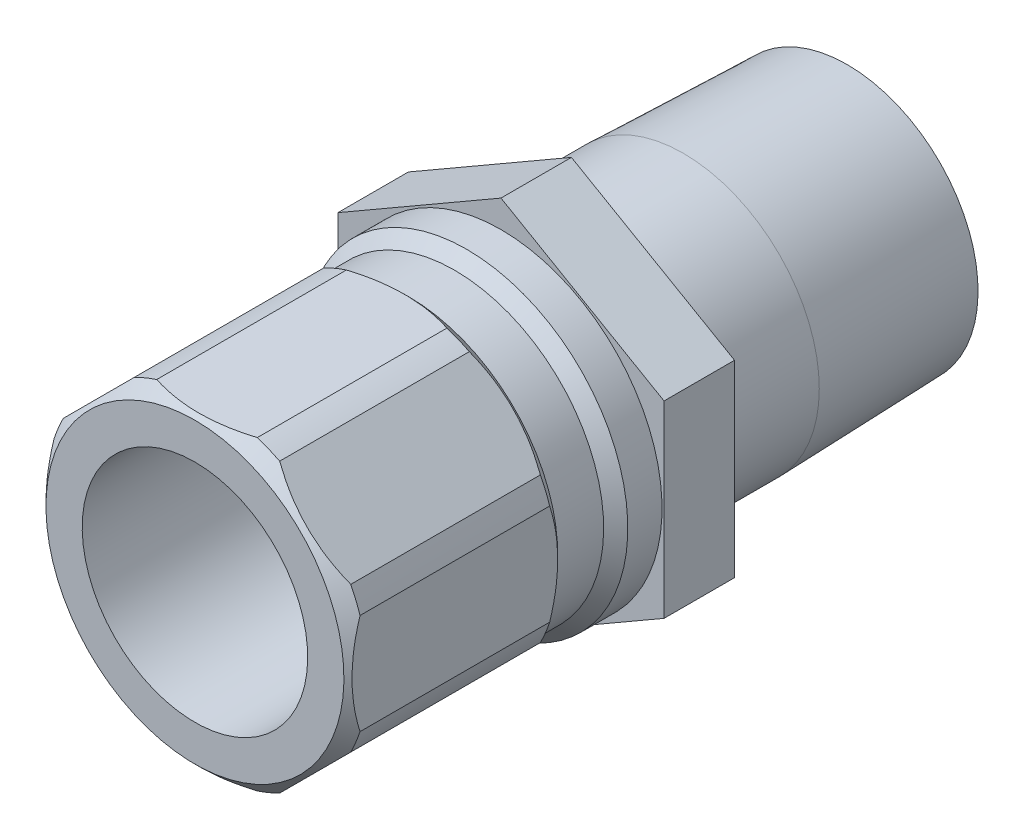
ISO-10303-21;
HEADER;
FILE_DESCRIPTION(('STEP AP214'),'2;1');
FILE_NAME('part.step','',(''),(''),'','','');
FILE_SCHEMA(('AUTOMOTIVE_DESIGN { 1 0 10303 214 1 1 1 1 }'));
ENDSEC;
DATA;
#1=APPLICATION_CONTEXT('core data for automotive mechanical design processes');
#2=APPLICATION_PROTOCOL_DEFINITION('international standard','automotive_design',2000,#1);
#3=PRODUCT_CONTEXT('',#1,'mechanical');
#4=PRODUCT('Part','Part','',(#3));
#5=PRODUCT_RELATED_PRODUCT_CATEGORY('part','',(#4));
#6=PRODUCT_DEFINITION_FORMATION('','',#4);
#7=PRODUCT_DEFINITION_CONTEXT('part definition',#1,'design');
#8=PRODUCT_DEFINITION('design','',#6,#7);
#9=PRODUCT_DEFINITION_SHAPE('','',#8);
#10=(LENGTH_UNIT() NAMED_UNIT(*) SI_UNIT(.MILLI.,.METRE.));
#11=(NAMED_UNIT(*) PLANE_ANGLE_UNIT() SI_UNIT($,.RADIAN.));
#12=(NAMED_UNIT(*) SI_UNIT($,.STERADIAN.) SOLID_ANGLE_UNIT());
#13=UNCERTAINTY_MEASURE_WITH_UNIT(LENGTH_MEASURE(1.E-05),#10,'distance_accuracy_value','');
#14=(GEOMETRIC_REPRESENTATION_CONTEXT(3) GLOBAL_UNCERTAINTY_ASSIGNED_CONTEXT((#13)) GLOBAL_UNIT_ASSIGNED_CONTEXT((#10,
#11,#12)) REPRESENTATION_CONTEXT('',''));
#15=CARTESIAN_POINT('',(0.,0.,0.));
#16=DIRECTION('',(0.,0.,1.));
#17=DIRECTION('',(1.,0.,0.));
#18=AXIS2_PLACEMENT_3D('',#15,#16,#17);
#19=CARTESIAN_POINT('',(0.,0.,0.));
#20=DIRECTION('',(0.,0.,-1.));
#21=DIRECTION('',(0.,1.,0.));
#22=AXIS2_PLACEMENT_3D('',#19,#20,#21);
#23=CYLINDRICAL_SURFACE('',#22,10.16);
#24=DIRECTION('',(0.,0.,-1.));
#25=VECTOR('',#24,1.);
#26=CARTESIAN_POINT('',(9.06826191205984,-4.58172739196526,0.));
#27=LINE('',#26,#25);
#28=CARTESIAN_POINT('',(9.06826191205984,-4.58172739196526,6.5786));
#29=VERTEX_POINT('',#28);
#30=CARTESIAN_POINT('',(9.06826191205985,-4.58172739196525,18.542));
#31=VERTEX_POINT('',#30);
#32=EDGE_CURVE('E400',#29,#31,#27,.F.);
#33=ORIENTED_EDGE('',*,*,#32,.F.);
#34=CARTESIAN_POINT('',(0.,0.,6.5786));
#35=DIRECTION('',(0.,0.,-1.));
#36=DIRECTION('',(0.,1.,0.));
#37=AXIS2_PLACEMENT_3D('',#34,#35,#36);
#38=CIRCLE('',#37,10.16);
#39=CARTESIAN_POINT('',(9.652,-3.17245898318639,6.5786));
#40=VERTEX_POINT('',#39);
#41=EDGE_CURVE('E402',#40,#29,#38,.T.);
#42=ORIENTED_EDGE('',*,*,#41,.F.);
#43=DIRECTION('',(0.,0.,-1.));
#44=VECTOR('',#43,1.);
#45=CARTESIAN_POINT('',(9.652,-3.17245898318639,0.));
#46=LINE('',#45,#44);
#47=CARTESIAN_POINT('',(9.652,-3.1724589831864,18.542));
#48=VERTEX_POINT('',#47);
#49=EDGE_CURVE('E380',#48,#40,#46,.T.);
#50=ORIENTED_EDGE('',*,*,#49,.F.);
#51=CARTESIAN_POINT('',(0.,0.,18.542));
#52=DIRECTION('',(0.,0.,-1.));
#53=DIRECTION('',(0.,1.,0.));
#54=AXIS2_PLACEMENT_3D('',#51,#52,#53);
#55=CIRCLE('',#54,10.16);
#56=EDGE_CURVE('E218',#48,#31,#55,.T.);
#57=ORIENTED_EDGE('',*,*,#56,.T.);
#58=EDGE_LOOP('',(#33,#42,#50,#57));
#59=FACE_BOUND('',#58,.T.);
#60=ADVANCED_FACE('F35',(#59),#23,.T.);
#61=DIRECTION('',(0.,0.,-1.));
#62=VECTOR('',#61,1.);
#63=CARTESIAN_POINT('',(9.652,3.1724589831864,0.));
#64=LINE('',#63,#62);
#65=CARTESIAN_POINT('',(9.652,3.1724589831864,6.5786));
#66=VERTEX_POINT('',#65);
#67=CARTESIAN_POINT('',(9.652,3.1724589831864,18.542));
#68=VERTEX_POINT('',#67);
#69=EDGE_CURVE('E321',#66,#68,#64,.F.);
#70=ORIENTED_EDGE('',*,*,#69,.F.);
#71=CARTESIAN_POINT('',(9.06826191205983,4.58172739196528,6.5786));
#72=VERTEX_POINT('',#71);
#73=EDGE_CURVE('E234',#72,#66,#38,.T.);
#74=ORIENTED_EDGE('',*,*,#73,.F.);
#75=DIRECTION('',(0.,0.,-1.));
#76=VECTOR('',#75,1.);
#77=CARTESIAN_POINT('',(9.06826191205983,4.58172739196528,0.));
#78=LINE('',#77,#76);
#79=CARTESIAN_POINT('',(9.06826191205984,4.58172739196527,18.542));
#80=VERTEX_POINT('',#79);
#81=EDGE_CURVE('E396',#80,#72,#78,.T.);
#82=ORIENTED_EDGE('',*,*,#81,.F.);
#83=EDGE_CURVE('E226',#80,#68,#55,.T.);
#84=ORIENTED_EDGE('',*,*,#83,.T.);
#85=EDGE_LOOP('',(#70,#74,#82,#84));
#86=FACE_BOUND('',#85,.T.);
#87=ADVANCED_FACE('F395',(#86),#23,.T.);
#88=DIRECTION('',(0.,0.,-1.));
#89=VECTOR('',#88,1.);
#90=CARTESIAN_POINT('',(4.58172739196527,9.06826191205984,0.));
#91=LINE('',#90,#89);
#92=CARTESIAN_POINT('',(4.58172739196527,9.06826191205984,6.5786));
#93=VERTEX_POINT('',#92);
#94=CARTESIAN_POINT('',(4.58172739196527,9.06826191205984,18.542));
#95=VERTEX_POINT('',#94);
#96=EDGE_CURVE('E381',#93,#95,#91,.F.);
#97=ORIENTED_EDGE('',*,*,#96,.F.);
#98=CARTESIAN_POINT('',(3.17245898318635,9.65200000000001,6.5786));
#99=VERTEX_POINT('',#98);
#100=EDGE_CURVE('E230',#99,#93,#38,.T.);
#101=ORIENTED_EDGE('',*,*,#100,.F.);
#102=DIRECTION('',(0.,0.,-1.));
#103=VECTOR('',#102,1.);
#104=CARTESIAN_POINT('',(3.17245898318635,9.65200000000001,0.));
#105=LINE('',#104,#103);
#106=CARTESIAN_POINT('',(3.17245898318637,9.65200000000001,18.542));
#107=VERTEX_POINT('',#106);
#108=EDGE_CURVE('E427',#107,#99,#105,.T.);
#109=ORIENTED_EDGE('',*,*,#108,.F.);
#110=EDGE_CURVE('E221',#107,#95,#55,.T.);
#111=ORIENTED_EDGE('',*,*,#110,.T.);
#112=EDGE_LOOP('',(#97,#101,#109,#111));
#113=FACE_BOUND('',#112,.T.);
#114=ADVANCED_FACE('F529',(#113),#23,.T.);
#115=DIRECTION('',(0.,0.,-1.));
#116=VECTOR('',#115,1.);
#117=CARTESIAN_POINT('',(-3.17245898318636,9.65200000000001,0.));
#118=LINE('',#117,#116);
#119=CARTESIAN_POINT('',(-3.17245898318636,9.65200000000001,6.5786));
#120=VERTEX_POINT('',#119);
#121=CARTESIAN_POINT('',(-3.17245898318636,9.65200000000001,18.542));
#122=VERTEX_POINT('',#121);
#123=EDGE_CURVE('E55',#120,#122,#118,.F.);
#124=ORIENTED_EDGE('',*,*,#123,.F.);
#125=CARTESIAN_POINT('',(-4.5817273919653,9.06826191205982,6.5786));
#126=VERTEX_POINT('',#125);
#127=EDGE_CURVE('E225',#126,#120,#38,.T.);
#128=ORIENTED_EDGE('',*,*,#127,.F.);
#129=DIRECTION('',(0.,0.,-1.));
#130=VECTOR('',#129,1.);
#131=CARTESIAN_POINT('',(-4.5817273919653,9.06826191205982,0.));
#132=LINE('',#131,#130);
#133=CARTESIAN_POINT('',(-4.58172739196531,9.06826191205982,18.542));
#134=VERTEX_POINT('',#133);
#135=EDGE_CURVE('E425',#134,#126,#132,.T.);
#136=ORIENTED_EDGE('',*,*,#135,.F.);
#137=EDGE_CURVE('E227',#134,#122,#55,.T.);
#138=ORIENTED_EDGE('',*,*,#137,.T.);
#139=EDGE_LOOP('',(#124,#128,#136,#138));
#140=FACE_BOUND('',#139,.T.);
#141=ADVANCED_FACE('F423',(#140),#23,.T.);
#142=DIRECTION('',(0.,0.,-1.));
#143=VECTOR('',#142,1.);
#144=CARTESIAN_POINT('',(-9.06826191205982,4.58172739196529,0.));
#145=LINE('',#144,#143);
#146=CARTESIAN_POINT('',(-9.06826191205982,4.58172739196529,6.5786));
#147=VERTEX_POINT('',#146);
#148=CARTESIAN_POINT('',(-9.06826191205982,4.5817273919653,18.542));
#149=VERTEX_POINT('',#148);
#150=EDGE_CURVE('E63',#147,#149,#145,.F.);
#151=ORIENTED_EDGE('',*,*,#150,.F.);
#152=CARTESIAN_POINT('',(-9.652,3.17245898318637,6.5786));
#153=VERTEX_POINT('',#152);
#154=EDGE_CURVE('E410',#153,#147,#38,.T.);
#155=ORIENTED_EDGE('',*,*,#154,.F.);
#156=DIRECTION('',(0.,0.,-1.));
#157=VECTOR('',#156,1.);
#158=CARTESIAN_POINT('',(-9.652,3.17245898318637,0.));
#159=LINE('',#158,#157);
#160=CARTESIAN_POINT('',(-9.652,3.17245898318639,18.542));
#161=VERTEX_POINT('',#160);
#162=EDGE_CURVE('E432',#161,#153,#159,.T.);
#163=ORIENTED_EDGE('',*,*,#162,.F.);
#164=EDGE_CURVE('E220',#161,#149,#55,.T.);
#165=ORIENTED_EDGE('',*,*,#164,.T.);
#166=EDGE_LOOP('',(#151,#155,#163,#165));
#167=FACE_BOUND('',#166,.T.);
#168=ADVANCED_FACE('F515',(#167),#23,.T.);
#169=DIRECTION('',(0.,0.,-1.));
#170=VECTOR('',#169,1.);
#171=CARTESIAN_POINT('',(-9.652,-3.17245898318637,0.));
#172=LINE('',#171,#170);
#173=CARTESIAN_POINT('',(-9.652,-3.17245898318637,6.5786));
#174=VERTEX_POINT('',#173);
#175=CARTESIAN_POINT('',(-9.652,-3.17245898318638,18.542));
#176=VERTEX_POINT('',#175);
#177=EDGE_CURVE('E429',#174,#176,#172,.F.);
#178=ORIENTED_EDGE('',*,*,#177,.F.);
#179=CARTESIAN_POINT('',(-9.06826191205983,-4.58172739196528,6.5786));
#180=VERTEX_POINT('',#179);
#181=EDGE_CURVE('E407',#180,#174,#38,.T.);
#182=ORIENTED_EDGE('',*,*,#181,.F.);
#183=DIRECTION('',(0.,0.,-1.));
#184=VECTOR('',#183,1.);
#185=CARTESIAN_POINT('',(-9.06826191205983,-4.58172739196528,0.));
#186=LINE('',#185,#184);
#187=CARTESIAN_POINT('',(-9.06826191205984,-4.58172739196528,18.542));
#188=VERTEX_POINT('',#187);
#189=EDGE_CURVE('E437',#188,#180,#186,.T.);
#190=ORIENTED_EDGE('',*,*,#189,.F.);
#191=EDGE_CURVE('E216',#188,#176,#55,.T.);
#192=ORIENTED_EDGE('',*,*,#191,.T.);
#193=EDGE_LOOP('',(#178,#182,#190,#192));
#194=FACE_BOUND('',#193,.T.);
#195=ADVANCED_FACE('F518',(#194),#23,.T.);
#196=DIRECTION('',(0.,0.,-1.));
#197=VECTOR('',#196,1.);
#198=CARTESIAN_POINT('',(-4.58172739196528,-9.06826191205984,0.));
#199=LINE('',#198,#197);
#200=CARTESIAN_POINT('',(-4.58172739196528,-9.06826191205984,6.5786));
#201=VERTEX_POINT('',#200);
#202=CARTESIAN_POINT('',(-4.58172739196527,-9.06826191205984,18.542));
#203=VERTEX_POINT('',#202);
#204=EDGE_CURVE('E435',#201,#203,#199,.F.);
#205=ORIENTED_EDGE('',*,*,#204,.F.);
#206=CARTESIAN_POINT('',(-3.17245898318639,-9.652,6.5786));
#207=VERTEX_POINT('',#206);
#208=EDGE_CURVE('E208',#207,#201,#38,.T.);
#209=ORIENTED_EDGE('',*,*,#208,.F.);
#210=DIRECTION('',(0.,0.,-1.));
#211=VECTOR('',#210,1.);
#212=CARTESIAN_POINT('',(-3.17245898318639,-9.652,0.));
#213=LINE('',#212,#211);
#214=CARTESIAN_POINT('',(-3.17245898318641,-9.652,18.542));
#215=VERTEX_POINT('',#214);
#216=EDGE_CURVE('E190',#215,#207,#213,.T.);
#217=ORIENTED_EDGE('',*,*,#216,.F.);
#218=EDGE_CURVE('E206',#215,#203,#55,.T.);
#219=ORIENTED_EDGE('',*,*,#218,.T.);
#220=EDGE_LOOP('',(#205,#209,#217,#219));
#221=FACE_BOUND('',#220,.T.);
#222=ADVANCED_FACE('F205',(#221),#23,.T.);
#223=CARTESIAN_POINT('',(0.,0.,0.));
#224=DIRECTION('',(0.,0.,-1.));
#225=DIRECTION('',(0.,1.,0.));
#226=AXIS2_PLACEMENT_3D('',#223,#224,#225);
#227=CYLINDRICAL_SURFACE('',#226,8.5725);
#228=CARTESIAN_POINT('',(0.,0.,-11.5062));
#229=DIRECTION('',(0.,0.,-1.));
#230=DIRECTION('',(0.,1.,0.));
#231=AXIS2_PLACEMENT_3D('',#228,#229,#230);
#232=CIRCLE('',#231,8.5725);
#233=CARTESIAN_POINT('',(0.,8.5725,-11.5062));
#234=VERTEX_POINT('',#233);
#235=EDGE_CURVE('E246',#234,#234,#232,.T.);
#236=ORIENTED_EDGE('',*,*,#235,.F.);
#237=EDGE_LOOP('',(#236));
#238=FACE_BOUND('',#237,.T.);
#239=CARTESIAN_POINT('',(0.,0.,-4.445));
#240=DIRECTION('',(0.,0.,1.));
#241=DIRECTION('',(1.,0.,0.));
#242=AXIS2_PLACEMENT_3D('',#239,#240,#241);
#243=CIRCLE('',#242,8.5725);
#244=CARTESIAN_POINT('',(8.5725,0.,-4.445));
#245=VERTEX_POINT('',#244);
#246=EDGE_CURVE('E486',#245,#245,#243,.F.);
#247=ORIENTED_EDGE('',*,*,#246,.T.);
#248=EDGE_LOOP('',(#247));
#249=FACE_BOUND('',#248,.T.);
#250=ADVANCED_FACE('F524',(#238,#249),#227,.T.);
#251=CARTESIAN_POINT('',(0.,8.24944566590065,-21.844));
#252=DIRECTION('',(0.,0.,-1.));
#253=DIRECTION('',(0.,1.,0.));
#254=AXIS2_PLACEMENT_3D('',#251,#252,#253);
#255=PLANE('',#254);
#256=CARTESIAN_POINT('',(0.,0.,-21.844));
#257=DIRECTION('',(0.,0.,-1.));
#258=DIRECTION('',(0.,1.,0.));
#259=AXIS2_PLACEMENT_3D('',#256,#257,#258);
#260=CIRCLE('',#259,8.24944566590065);
#261=CARTESIAN_POINT('',(0.,8.24944566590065,-21.844));
#262=VERTEX_POINT('',#261);
#263=EDGE_CURVE('E199',#262,#262,#260,.T.);
#264=ORIENTED_EDGE('',*,*,#263,.T.);
#265=EDGE_LOOP('',(#264));
#266=FACE_BOUND('',#265,.T.);
#267=CARTESIAN_POINT('',(0.,0.,-21.844));
#268=DIRECTION('',(0.,0.,-1.));
#269=DIRECTION('',(0.,1.,0.));
#270=AXIS2_PLACEMENT_3D('',#267,#268,#269);
#271=CIRCLE('',#270,6.2611);
#272=CARTESIAN_POINT('',(0.,6.2611,-21.844));
#273=VERTEX_POINT('',#272);
#274=EDGE_CURVE('E498',#273,#273,#271,.T.);
#275=ORIENTED_EDGE('',*,*,#274,.F.);
#276=EDGE_LOOP('',(#275));
#277=FACE_BOUND('',#276,.T.);
#278=ADVANCED_FACE('F37',(#266,#277),#255,.T.);
#279=CARTESIAN_POINT('',(0.,0.,-21.844));
#280=DIRECTION('',(0.,0.,1.));
#281=DIRECTION('',(0.,-1.,0.));
#282=AXIS2_PLACEMENT_3D('',#279,#280,#281);
#283=CONICAL_SURFACE('',#282,8.24944566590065,0.0312396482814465);
#284=ORIENTED_EDGE('',*,*,#235,.T.);
#285=EDGE_LOOP('',(#284));
#286=FACE_BOUND('',#285,.T.);
#287=ORIENTED_EDGE('',*,*,#263,.F.);
#288=EDGE_LOOP('',(#287));
#289=FACE_BOUND('',#288,.T.);
#290=ADVANCED_FACE('F789',(#286,#289),#283,.T.);
#291=CARTESIAN_POINT('',(0.,0.,0.));
#292=DIRECTION('',(0.,0.,-1.));
#293=DIRECTION('',(0.,1.,0.));
#294=AXIS2_PLACEMENT_3D('',#291,#292,#293);
#295=CYLINDRICAL_SURFACE('',#294,10.16);
#296=CARTESIAN_POINT('',(0.,0.,2.159));
#297=DIRECTION('',(0.,0.,-1.));
#298=DIRECTION('',(0.,1.,0.));
#299=AXIS2_PLACEMENT_3D('',#296,#297,#298);
#300=CIRCLE('',#299,10.16);
#301=CARTESIAN_POINT('',(0.,10.16,2.159));
#302=VERTEX_POINT('',#301);
#303=EDGE_CURVE('E240',#302,#302,#300,.T.);
#304=ORIENTED_EDGE('',*,*,#303,.T.);
#305=EDGE_LOOP('',(#304));
#306=FACE_BOUND('',#305,.T.);
#307=CARTESIAN_POINT('',(0.,0.,0.));
#308=DIRECTION('',(0.,0.,-1.));
#309=DIRECTION('',(0.,1.,0.));
#310=AXIS2_PLACEMENT_3D('',#307,#308,#309);
#311=CIRCLE('',#310,10.16);
#312=CARTESIAN_POINT('',(0.,10.16,0.));
#313=VERTEX_POINT('',#312);
#314=EDGE_CURVE('E243',#313,#313,#311,.T.);
#315=ORIENTED_EDGE('',*,*,#314,.F.);
#316=EDGE_LOOP('',(#315));
#317=FACE_BOUND('',#316,.T.);
#318=ADVANCED_FACE('F781',(#306,#317),#295,.T.);
#319=CARTESIAN_POINT('',(0.,0.,2.159));
#320=DIRECTION('',(0.,0.,-1.));
#321=DIRECTION('',(0.,1.,0.));
#322=AXIS2_PLACEMENT_3D('',#319,#320,#321);
#323=CONICAL_SURFACE('',#322,10.16,0.785398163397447);
#324=CARTESIAN_POINT('',(0.,0.,2.921));
#325=DIRECTION('',(0.,0.,-1.));
#326=DIRECTION('',(0.,1.,0.));
#327=AXIS2_PLACEMENT_3D('',#324,#325,#326);
#328=CIRCLE('',#327,9.398);
#329=CARTESIAN_POINT('',(0.,9.398,2.921));
#330=VERTEX_POINT('',#329);
#331=EDGE_CURVE('E237',#330,#330,#328,.T.);
#332=ORIENTED_EDGE('',*,*,#331,.T.);
#333=EDGE_LOOP('',(#332));
#334=FACE_BOUND('',#333,.T.);
#335=ORIENTED_EDGE('',*,*,#303,.F.);
#336=EDGE_LOOP('',(#335));
#337=FACE_BOUND('',#336,.T.);
#338=ADVANCED_FACE('F773',(#334,#337),#323,.T.);
#339=CARTESIAN_POINT('',(0.,0.,0.));
#340=DIRECTION('',(0.,0.,-1.));
#341=DIRECTION('',(0.,1.,0.));
#342=AXIS2_PLACEMENT_3D('',#339,#340,#341);
#343=CYLINDRICAL_SURFACE('',#342,9.398);
#344=CARTESIAN_POINT('',(0.,0.,5.8166));
#345=DIRECTION('',(0.,0.,-1.));
#346=DIRECTION('',(0.,1.,0.));
#347=AXIS2_PLACEMENT_3D('',#344,#345,#346);
#348=CIRCLE('',#347,9.398);
#349=CARTESIAN_POINT('',(0.,9.398,5.8166));
#350=VERTEX_POINT('',#349);
#351=EDGE_CURVE('E233',#350,#350,#348,.T.);
#352=ORIENTED_EDGE('',*,*,#351,.T.);
#353=EDGE_LOOP('',(#352));
#354=FACE_BOUND('',#353,.T.);
#355=ORIENTED_EDGE('',*,*,#331,.F.);
#356=EDGE_LOOP('',(#355));
#357=FACE_BOUND('',#356,.T.);
#358=ADVANCED_FACE('F328',(#354,#357),#343,.T.);
#359=CARTESIAN_POINT('',(0.,0.,5.8166));
#360=DIRECTION('',(0.,0.,1.));
#361=DIRECTION('',(0.,-1.,0.));
#362=AXIS2_PLACEMENT_3D('',#359,#360,#361);
#363=CONICAL_SURFACE('',#362,9.398,0.785398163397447);
#364=CARTESIAN_POINT('',(4.58127452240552,-9.06871478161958,6.57880000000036));
#365=CARTESIAN_POINT('',(4.75252279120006,-8.89746651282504,6.50311112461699));
#366=CARTESIAN_POINT('',(4.92544531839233,-8.72454398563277,6.4345998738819));
#367=CARTESIAN_POINT('',(5.27427443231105,-8.37571487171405,6.31373109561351));
#368=CARTESIAN_POINT('',(5.45018402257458,-8.19980528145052,6.26139098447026));
#369=CARTESIAN_POINT('',(5.80016102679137,-7.84982827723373,6.17583376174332));
#370=CARTESIAN_POINT('',(5.97417704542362,-7.67581225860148,6.14220261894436));
#371=CARTESIAN_POINT('',(6.32342358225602,-7.32656572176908,6.09351088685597));
#372=CARTESIAN_POINT('',(6.4986534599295,-7.15133584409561,6.07844115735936));
#373=CARTESIAN_POINT('',(6.87393872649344,-6.77605057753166,6.06671407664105));
#374=CARTESIAN_POINT('',(7.07404283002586,-6.57594647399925,6.07292266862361));
#375=CARTESIAN_POINT('',(7.47322940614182,-6.17675989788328,6.10993961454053));
#376=CARTESIAN_POINT('',(7.67231100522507,-5.97767829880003,6.14076631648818));
#377=CARTESIAN_POINT('',(8.07332223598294,-5.57666706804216,6.22661050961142));
#378=CARTESIAN_POINT('',(8.27518426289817,-5.37480504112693,6.28225688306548));
#379=CARTESIAN_POINT('',(8.57507776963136,-5.07491153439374,6.38192162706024));
#380=CARTESIAN_POINT('',(8.67450584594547,-4.97548345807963,6.41781854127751));
#381=CARTESIAN_POINT('',(8.87236427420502,-4.77762502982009,6.49463428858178));
#382=CARTESIAN_POINT('',(8.97079484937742,-4.67919445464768,6.53555196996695));
#383=CARTESIAN_POINT('',(9.06871478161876,-4.58127452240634,6.5788));
#384=B_SPLINE_CURVE_WITH_KNOTS('',3,(#364,#365,#366,#367,#368,#369,#370,#371,#372,#373,#374,
#375,#376,#377,#378,#379,#380,#381,#382,#383),.UNSPECIFIED.,.F.,.F.,(4,2,2,2,2,2,2,2,2,4),(0.,
0.761268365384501,1.52335378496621,2.26782503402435,3.01192953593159,3.85997332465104,
4.7086497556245,5.58017277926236,6.01546212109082,6.45065179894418),.UNSPECIFIED.);
#385=CARTESIAN_POINT('',(4.58172739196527,-9.06826191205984,6.5786));
#386=VERTEX_POINT('',#385);
#387=EDGE_CURVE('E442',#386,#29,#384,.T.);
#388=ORIENTED_EDGE('',*,*,#387,.F.);
#389=CARTESIAN_POINT('',(3.1724589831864,-9.652,6.5786));
#390=VERTEX_POINT('',#389);
#391=EDGE_CURVE('E404',#386,#390,#38,.T.);
#392=ORIENTED_EDGE('',*,*,#391,.T.);
#393=CARTESIAN_POINT('',(-7.71050187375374,-9.652,8.77226112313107));
#394=CARTESIAN_POINT('',(-7.5247548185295,-9.652,8.65634461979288));
#395=CARTESIAN_POINT('',(-7.33786285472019,-9.652,8.54223754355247));
#396=CARTESIAN_POINT('',(-6.96152272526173,-9.652,8.31821876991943));
#397=CARTESIAN_POINT('',(-6.77207395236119,-9.652,8.20830809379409));
#398=CARTESIAN_POINT('',(-6.38961701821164,-9.652,7.99284972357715));
#399=CARTESIAN_POINT('',(-6.19659699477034,-9.652,7.88732298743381));
#400=CARTESIAN_POINT('',(-5.80760245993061,-9.652,7.6819077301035));
#401=CARTESIAN_POINT('',(-5.61162813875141,-9.652,7.58201884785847));
#402=CARTESIAN_POINT('',(-5.0102125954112,-9.652,7.28777670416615));
#403=CARTESIAN_POINT('',(-4.59965798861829,-9.652,7.10365831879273));
#404=CARTESIAN_POINT('',(-3.76461195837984,-9.652,6.77173137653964));
#405=CARTESIAN_POINT('',(-3.34014745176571,-9.652,6.62385690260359));
#406=CARTESIAN_POINT('',(-2.66836152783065,-9.652,6.43000243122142));
#407=CARTESIAN_POINT('',(-2.42567962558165,-9.652,6.36787612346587));
#408=CARTESIAN_POINT('',(-1.9366245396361,-9.652,6.260082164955));
#409=CARTESIAN_POINT('',(-1.69025117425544,-9.652,6.21441532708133));
#410=CARTESIAN_POINT('',(-1.1971622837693,-9.652,6.14153377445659));
#411=CARTESIAN_POINT('',(-0.950472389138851,-9.652,6.11414737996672));
#412=CARTESIAN_POINT('',(-0.455710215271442,-9.652,6.07820091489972));
#413=CARTESIAN_POINT('',(-0.207637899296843,-9.65199999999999,6.0696413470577));
#414=CARTESIAN_POINT('',(0.33368349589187,-9.65199999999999,6.07191804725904));
#415=CARTESIAN_POINT('',(0.626923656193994,-9.65199999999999,6.0865748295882));
#416=CARTESIAN_POINT('',(1.21094277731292,-9.65199999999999,6.14191623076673));
#417=CARTESIAN_POINT('',(1.501721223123,-9.65199999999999,6.1826061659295));
#418=CARTESIAN_POINT('',(2.08266136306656,-9.65199999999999,6.28854909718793));
#419=CARTESIAN_POINT('',(2.3727646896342,-9.65199999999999,6.3541179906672));
#420=CARTESIAN_POINT('',(2.94714147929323,-9.65199999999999,6.50671348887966));
#421=CARTESIAN_POINT('',(3.23141585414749,-9.65199999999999,6.5937367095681));
#422=CARTESIAN_POINT('',(3.82869981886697,-9.65199999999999,6.79798966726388));
#423=CARTESIAN_POINT('',(4.14087760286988,-9.65199999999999,6.91763184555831));
#424=CARTESIAN_POINT('',(4.75742701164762,-9.65199999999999,7.17572587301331));
#425=CARTESIAN_POINT('',(5.06179505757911,-9.65199999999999,7.31418616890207));
#426=CARTESIAN_POINT('',(5.66409479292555,-9.65199999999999,7.60669849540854));
#427=CARTESIAN_POINT('',(5.9620026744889,-9.65199999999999,7.76079916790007));
#428=CARTESIAN_POINT('',(6.55107386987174,-9.65199999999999,8.08121555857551));
#429=CARTESIAN_POINT('',(6.84223818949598,-9.65199999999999,8.24752943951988));
#430=CARTESIAN_POINT('',(7.40668231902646,-9.65199999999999,8.58292080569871));
#431=CARTESIAN_POINT('',(7.68020242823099,-9.65199999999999,8.75159598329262));
#432=CARTESIAN_POINT('',(8.22250898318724,-9.65199999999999,9.09641460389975));
#433=CARTESIAN_POINT('',(8.49129505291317,-9.65199999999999,9.27255863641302));
#434=CARTESIAN_POINT('',(9.02258177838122,-9.65199999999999,9.62956600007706));
#435=CARTESIAN_POINT('',(9.28511552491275,-9.65199999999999,9.8103802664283));
#436=CARTESIAN_POINT('',(9.80652727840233,-9.65199999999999,10.1770543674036));
#437=CARTESIAN_POINT('',(10.0654063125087,-9.65199999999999,10.3629127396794));
#438=CARTESIAN_POINT('',(10.3227473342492,-9.65199999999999,10.5508403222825));
#439=B_SPLINE_CURVE_WITH_KNOTS('',3,(#393,#394,#395,#396,#397,#398,#399,#400,#401,#402,#403,
#404,#405,#406,#407,#408,#409,#410,#411,#412,#413,#414,#415,#416,#417,#418,#419,#420,#421,#422,
#423,#424,#425,#426,#427,#428,#429,#430,#431,#432,#433,#434,#435,#436,#437,#438),.UNSPECIFIED.,
.F.,.F.,(4,2,2,2,2,2,2,2,2,2,2,2,2,2,2,2,2,2,2,2,2,2,4),(0.,0.656855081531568,1.31386901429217,
1.97372850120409,2.63354568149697,3.98211483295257,5.32821282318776,6.07925616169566,
6.83033658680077,7.57426013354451,8.31820354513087,9.1977741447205,10.0775244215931,
10.9688407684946,11.8600166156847,12.8622077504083,13.8648502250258,14.8707124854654,
15.8764237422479,16.8403261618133,17.8043048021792,18.7605668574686,19.7165545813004),.UNSPECIFIED.);
#440=EDGE_CURVE('E334',#207,#390,#439,.T.);
#441=ORIENTED_EDGE('',*,*,#440,.F.);
#442=ORIENTED_EDGE('',*,*,#208,.T.);
#443=CARTESIAN_POINT('',(-9.06871478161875,-4.58127452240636,6.5788));
#444=CARTESIAN_POINT('',(-8.89746651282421,-4.7525227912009,6.50311112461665));
#445=CARTESIAN_POINT('',(-8.72454398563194,-4.92544531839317,6.43459987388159));
#446=CARTESIAN_POINT('',(-8.37571487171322,-5.27427443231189,6.31373109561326));
#447=CARTESIAN_POINT('',(-8.1998052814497,-5.45018402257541,6.26139098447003));
#448=CARTESIAN_POINT('',(-7.84982827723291,-5.8001610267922,6.17583376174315));
#449=CARTESIAN_POINT('',(-7.67581225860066,-5.97417704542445,6.14220261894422));
#450=CARTESIAN_POINT('',(-7.32656572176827,-6.32342358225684,6.09351088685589));
#451=CARTESIAN_POINT('',(-7.1513358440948,-6.49865345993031,6.07844115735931));
#452=CARTESIAN_POINT('',(-6.77605057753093,-6.87393872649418,6.06671407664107));
#453=CARTESIAN_POINT('',(-6.57594647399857,-7.07404283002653,6.07292266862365));
#454=CARTESIAN_POINT('',(-6.17675989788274,-7.47322940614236,6.10993961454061));
#455=CARTESIAN_POINT('',(-5.97767829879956,-7.67231100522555,6.14076631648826));
#456=CARTESIAN_POINT('',(-5.57666706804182,-8.07332223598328,6.22661050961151));
#457=CARTESIAN_POINT('',(-5.37480504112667,-8.27518426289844,6.28225688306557));
#458=CARTESIAN_POINT('',(-5.07491153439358,-8.57507776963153,6.3819216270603));
#459=CARTESIAN_POINT('',(-4.97548345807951,-8.6745058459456,6.41781854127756));
#460=CARTESIAN_POINT('',(-4.77762502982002,-8.87236427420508,6.49463428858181));
#461=CARTESIAN_POINT('',(-4.67919445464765,-8.97079484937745,6.53555196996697));
#462=CARTESIAN_POINT('',(-4.58127452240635,-9.06871478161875,6.5788));
#463=B_SPLINE_CURVE_WITH_KNOTS('',3,(#443,#444,#445,#446,#447,#448,#449,#450,#451,#452,#453,
#454,#455,#456,#457,#458,#459,#460,#461,#462),.UNSPECIFIED.,.F.,.F.,(4,2,2,2,2,2,2,2,2,4),(0.,
0.761268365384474,1.52335378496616,2.26782503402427,3.01192953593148,3.85997332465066,
4.70864975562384,5.5801727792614,6.01546212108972,6.45065179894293),.UNSPECIFIED.);
#464=EDGE_CURVE('E344',#180,#201,#463,.T.);
#465=ORIENTED_EDGE('',*,*,#464,.F.);
#466=ORIENTED_EDGE('',*,*,#181,.T.);
#467=CARTESIAN_POINT('',(-9.652,-7.71050187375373,8.77226112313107));
#468=CARTESIAN_POINT('',(-9.652,-7.52475481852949,8.65634461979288));
#469=CARTESIAN_POINT('',(-9.652,-7.33786285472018,8.54223754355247));
#470=CARTESIAN_POINT('',(-9.652,-6.96152272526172,8.31821876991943));
#471=CARTESIAN_POINT('',(-9.652,-6.77207395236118,8.20830809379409));
#472=CARTESIAN_POINT('',(-9.652,-6.38961701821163,7.99284972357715));
#473=CARTESIAN_POINT('',(-9.652,-6.19659699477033,7.88732298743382));
#474=CARTESIAN_POINT('',(-9.652,-5.80760245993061,7.6819077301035));
#475=CARTESIAN_POINT('',(-9.652,-5.6116281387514,7.58201884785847));
#476=CARTESIAN_POINT('',(-9.652,-5.01021259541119,7.28777670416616));
#477=CARTESIAN_POINT('',(-9.652,-4.59965798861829,7.10365831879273));
#478=CARTESIAN_POINT('',(-9.652,-3.76461195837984,6.77173137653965));
#479=CARTESIAN_POINT('',(-9.652,-3.34014745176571,6.6238569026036));
#480=CARTESIAN_POINT('',(-9.652,-2.66836152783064,6.43000243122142));
#481=CARTESIAN_POINT('',(-9.652,-2.42567962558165,6.36787612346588));
#482=CARTESIAN_POINT('',(-9.652,-1.9366245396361,6.260082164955));
#483=CARTESIAN_POINT('',(-9.652,-1.69025117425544,6.21441532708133));
#484=CARTESIAN_POINT('',(-9.652,-1.1971622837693,6.1415337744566));
#485=CARTESIAN_POINT('',(-9.652,-0.950472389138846,6.11414737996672));
#486=CARTESIAN_POINT('',(-9.652,-0.455710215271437,6.07820091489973));
#487=CARTESIAN_POINT('',(-9.652,-0.207637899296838,6.06964134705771));
#488=CARTESIAN_POINT('',(-9.652,0.333683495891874,6.07191804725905));
#489=CARTESIAN_POINT('',(-9.652,0.626923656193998,6.08657482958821));
#490=CARTESIAN_POINT('',(-9.652,1.21094277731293,6.14191623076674));
#491=CARTESIAN_POINT('',(-9.652,1.501721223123,6.18260616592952));
#492=CARTESIAN_POINT('',(-9.652,2.08266136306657,6.28854909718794));
#493=CARTESIAN_POINT('',(-9.652,2.37276468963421,6.35411799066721));
#494=CARTESIAN_POINT('',(-9.652,2.94714147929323,6.50671348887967));
#495=CARTESIAN_POINT('',(-9.652,3.2314158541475,6.59373670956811));
#496=CARTESIAN_POINT('',(-9.652,3.82869981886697,6.79798966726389));
#497=CARTESIAN_POINT('',(-9.652,4.14087760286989,6.91763184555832));
#498=CARTESIAN_POINT('',(-9.652,4.75742701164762,7.17572587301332));
#499=CARTESIAN_POINT('',(-9.652,5.06179505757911,7.31418616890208));
#500=CARTESIAN_POINT('',(-9.652,5.66409479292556,7.60669849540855));
#501=CARTESIAN_POINT('',(-9.652,5.96200267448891,7.76079916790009));
#502=CARTESIAN_POINT('',(-9.652,6.55107386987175,8.08121555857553));
#503=CARTESIAN_POINT('',(-9.652,6.84223818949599,8.2475294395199));
#504=CARTESIAN_POINT('',(-9.652,7.40668231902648,8.58292080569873));
#505=CARTESIAN_POINT('',(-9.652,7.68020242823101,8.75159598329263));
#506=CARTESIAN_POINT('',(-9.652,8.22250898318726,9.09641460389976));
#507=CARTESIAN_POINT('',(-9.652,8.49129505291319,9.27255863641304));
#508=CARTESIAN_POINT('',(-9.652,9.02258177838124,9.62956600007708));
#509=CARTESIAN_POINT('',(-9.652,9.28511552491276,9.81038026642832));
#510=CARTESIAN_POINT('',(-9.652,9.80652727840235,10.1770543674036));
#511=CARTESIAN_POINT('',(-9.652,10.0654063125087,10.3629127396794));
#512=CARTESIAN_POINT('',(-9.652,10.3227473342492,10.5508403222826));
#513=B_SPLINE_CURVE_WITH_KNOTS('',3,(#467,#468,#469,#470,#471,#472,#473,#474,#475,#476,#477,
#478,#479,#480,#481,#482,#483,#484,#485,#486,#487,#488,#489,#490,#491,#492,#493,#494,#495,#496,
#497,#498,#499,#500,#501,#502,#503,#504,#505,#506,#507,#508,#509,#510,#511,#512),.UNSPECIFIED.,
.F.,.F.,(4,2,2,2,2,2,2,2,2,2,2,2,2,2,2,2,2,2,2,2,2,2,4),(0.,0.656855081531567,1.31386901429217,
1.97372850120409,2.63354568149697,3.98211483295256,5.32821282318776,6.07925616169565,
6.83033658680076,7.5742601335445,8.31820354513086,9.1977741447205,10.0775244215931,
10.9688407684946,11.8600166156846,12.8622077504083,13.8648502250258,14.8707124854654,
15.8764237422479,16.8403261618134,17.8043048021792,18.7605668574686,19.7165545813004),.UNSPECIFIED.);
#514=EDGE_CURVE('E352',#153,#174,#513,.F.);
#515=ORIENTED_EDGE('',*,*,#514,.F.);
#516=ORIENTED_EDGE('',*,*,#154,.T.);
#517=CARTESIAN_POINT('',(-4.5812745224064,9.06871478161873,6.5788));
#518=CARTESIAN_POINT('',(-4.75252279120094,8.89746651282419,6.50311112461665));
#519=CARTESIAN_POINT('',(-4.9254453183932,8.72454398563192,6.43459987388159));
#520=CARTESIAN_POINT('',(-5.27427443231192,8.3757148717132,6.31373109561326));
#521=CARTESIAN_POINT('',(-5.45018402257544,8.19980528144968,6.26139098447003));
#522=CARTESIAN_POINT('',(-5.80016102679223,7.84982827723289,6.17583376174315));
#523=CARTESIAN_POINT('',(-5.97417704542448,7.67581225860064,6.14220261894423));
#524=CARTESIAN_POINT('',(-6.32342358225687,7.32656572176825,6.0935108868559));
#525=CARTESIAN_POINT('',(-6.49865345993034,7.15133584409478,6.07844115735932));
#526=CARTESIAN_POINT('',(-6.87393872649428,6.77605057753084,6.06671407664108));
#527=CARTESIAN_POINT('',(-7.0740428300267,6.57594647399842,6.07292266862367));
#528=CARTESIAN_POINT('',(-7.47322940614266,6.17675989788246,6.10993961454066));
#529=CARTESIAN_POINT('',(-7.67231100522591,5.97767829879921,6.14076631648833));
#530=CARTESIAN_POINT('',(-8.07332223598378,5.57666706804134,6.22661050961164));
#531=CARTESIAN_POINT('',(-8.275184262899,5.37480504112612,6.28225688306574));
#532=CARTESIAN_POINT('',(-8.57507776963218,5.07491153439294,6.38192162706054));
#533=CARTESIAN_POINT('',(-8.67450584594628,4.97548345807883,6.41781854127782));
#534=CARTESIAN_POINT('',(-8.87236427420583,4.77762502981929,6.49463428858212));
#535=CARTESIAN_POINT('',(-8.97079484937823,4.67919445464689,6.53555196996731));
#536=CARTESIAN_POINT('',(-9.06871478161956,4.58127452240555,6.57880000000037));
#537=B_SPLINE_CURVE_WITH_KNOTS('',3,(#517,#518,#519,#520,#521,#522,#523,#524,#525,#526,#527,
#528,#529,#530,#531,#532,#533,#534,#535,#536),.UNSPECIFIED.,.F.,.F.,(4,2,2,2,2,2,2,2,2,4),(0.,
0.761268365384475,1.52335378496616,2.26782503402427,3.01192953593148,3.85997332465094,
4.7086497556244,5.58017277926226,6.01546212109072,6.45065179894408),.UNSPECIFIED.);
#538=EDGE_CURVE('E360',#126,#147,#537,.T.);
#539=ORIENTED_EDGE('',*,*,#538,.F.);
#540=ORIENTED_EDGE('',*,*,#127,.T.);
#541=CARTESIAN_POINT('',(-7.71050187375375,9.652,8.77226112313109));
#542=CARTESIAN_POINT('',(-7.52475481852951,9.652,8.6563446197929));
#543=CARTESIAN_POINT('',(-7.3378628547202,9.652,8.54223754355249));
#544=CARTESIAN_POINT('',(-6.96152272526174,9.652,8.31821876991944));
#545=CARTESIAN_POINT('',(-6.77207395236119,9.652,8.2083080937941));
#546=CARTESIAN_POINT('',(-6.38961701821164,9.652,7.99284972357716));
#547=CARTESIAN_POINT('',(-6.19659699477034,9.652,7.88732298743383));
#548=CARTESIAN_POINT('',(-5.80760245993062,9.652,7.68190773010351));
#549=CARTESIAN_POINT('',(-5.61162813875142,9.65200000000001,7.58201884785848));
#550=CARTESIAN_POINT('',(-5.01021259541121,9.65200000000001,7.28777670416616));
#551=CARTESIAN_POINT('',(-4.5996579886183,9.65200000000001,7.10365831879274));
#552=CARTESIAN_POINT('',(-3.76461195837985,9.65200000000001,6.77173137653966));
#553=CARTESIAN_POINT('',(-3.34014745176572,9.65200000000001,6.62385690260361));
#554=CARTESIAN_POINT('',(-2.66836152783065,9.65200000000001,6.43000243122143));
#555=CARTESIAN_POINT('',(-2.42567962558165,9.65200000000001,6.36787612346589));
#556=CARTESIAN_POINT('',(-1.9366245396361,9.65200000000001,6.26008216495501));
#557=CARTESIAN_POINT('',(-1.69025117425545,9.65200000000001,6.21441532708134));
#558=CARTESIAN_POINT('',(-1.19716228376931,9.65200000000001,6.1415337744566));
#559=CARTESIAN_POINT('',(-0.950472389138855,9.65200000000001,6.11414737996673));
#560=CARTESIAN_POINT('',(-0.455710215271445,9.65200000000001,6.07820091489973));
#561=CARTESIAN_POINT('',(-0.207637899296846,9.65200000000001,6.06964134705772));
#562=CARTESIAN_POINT('',(0.333683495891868,9.65200000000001,6.07191804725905));
#563=CARTESIAN_POINT('',(0.626923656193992,9.65200000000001,6.08657482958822));
#564=CARTESIAN_POINT('',(1.21094277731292,9.65200000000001,6.14191623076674));
#565=CARTESIAN_POINT('',(1.501721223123,9.65200000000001,6.18260616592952));
#566=CARTESIAN_POINT('',(2.08266136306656,9.65200000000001,6.28854909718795));
#567=CARTESIAN_POINT('',(2.3727646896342,9.65200000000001,6.35411799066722));
#568=CARTESIAN_POINT('',(2.94714147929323,9.65200000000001,6.50671348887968));
#569=CARTESIAN_POINT('',(3.23141585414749,9.65200000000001,6.59373670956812));
#570=CARTESIAN_POINT('',(3.82869981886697,9.65200000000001,6.79798966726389));
#571=CARTESIAN_POINT('',(4.14087760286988,9.65200000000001,6.91763184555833));
#572=CARTESIAN_POINT('',(4.75742701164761,9.65200000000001,7.17572587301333));
#573=CARTESIAN_POINT('',(5.0617950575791,9.65200000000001,7.31418616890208));
#574=CARTESIAN_POINT('',(5.66409479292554,9.65200000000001,7.60669849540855));
#575=CARTESIAN_POINT('',(5.9620026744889,9.65200000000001,7.76079916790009));
#576=CARTESIAN_POINT('',(6.55107386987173,9.65200000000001,8.08121555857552));
#577=CARTESIAN_POINT('',(6.84223818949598,9.65200000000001,8.24752943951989));
#578=CARTESIAN_POINT('',(7.40668231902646,9.65200000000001,8.58292080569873));
#579=CARTESIAN_POINT('',(7.68020242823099,9.65200000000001,8.75159598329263));
#580=CARTESIAN_POINT('',(8.22250898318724,9.65200000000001,9.09641460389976));
#581=CARTESIAN_POINT('',(8.49129505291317,9.65200000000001,9.27255863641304));
#582=CARTESIAN_POINT('',(9.02258177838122,9.65200000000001,9.62956600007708));
#583=CARTESIAN_POINT('',(9.28511552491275,9.65200000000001,9.81038026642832));
#584=CARTESIAN_POINT('',(9.80652727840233,9.65200000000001,10.1770543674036));
#585=CARTESIAN_POINT('',(10.0654063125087,9.65200000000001,10.3629127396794));
#586=CARTESIAN_POINT('',(10.3227473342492,9.65200000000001,10.5508403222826));
#587=B_SPLINE_CURVE_WITH_KNOTS('',3,(#541,#542,#543,#544,#545,#546,#547,#548,#549,#550,#551,
#552,#553,#554,#555,#556,#557,#558,#559,#560,#561,#562,#563,#564,#565,#566,#567,#568,#569,#570,
#571,#572,#573,#574,#575,#576,#577,#578,#579,#580,#581,#582,#583,#584,#585,#586),.UNSPECIFIED.,
.F.,.F.,(4,2,2,2,2,2,2,2,2,2,2,2,2,2,2,2,2,2,2,2,2,2,4),(0.,0.656855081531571,1.31386901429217,
1.9737285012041,2.63354568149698,3.98211483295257,5.32821282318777,6.07925616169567,
6.83033658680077,7.57426013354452,8.31820354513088,9.19777414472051,10.0775244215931,
10.9688407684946,11.8600166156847,12.8622077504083,13.8648502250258,14.8707124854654,
15.8764237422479,16.8403261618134,17.8043048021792,18.7605668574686,19.7165545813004),.UNSPECIFIED.);
#588=EDGE_CURVE('E368',#99,#120,#587,.F.);
#589=ORIENTED_EDGE('',*,*,#588,.F.);
#590=ORIENTED_EDGE('',*,*,#100,.T.);
#591=CARTESIAN_POINT('',(9.06871478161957,4.58127452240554,6.57880000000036));
#592=CARTESIAN_POINT('',(8.89746651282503,4.75252279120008,6.50311112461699));
#593=CARTESIAN_POINT('',(8.72454398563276,4.92544531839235,6.4345998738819));
#594=CARTESIAN_POINT('',(8.37571487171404,5.27427443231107,6.31373109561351));
#595=CARTESIAN_POINT('',(8.19980528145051,5.45018402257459,6.26139098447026));
#596=CARTESIAN_POINT('',(7.84982827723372,5.80016102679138,6.17583376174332));
#597=CARTESIAN_POINT('',(7.67581225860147,5.97417704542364,6.14220261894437));
#598=CARTESIAN_POINT('',(7.32656572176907,6.32342358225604,6.09351088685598));
#599=CARTESIAN_POINT('',(7.1513358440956,6.49865345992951,6.07844115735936));
#600=CARTESIAN_POINT('',(6.77605057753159,6.87393872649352,6.06671407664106));
#601=CARTESIAN_POINT('',(6.5759464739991,7.07404283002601,6.07292266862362));
#602=CARTESIAN_POINT('',(6.176759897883,7.4732294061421,6.10993961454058));
#603=CARTESIAN_POINT('',(5.97767829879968,7.67231100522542,6.14076631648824));
#604=CARTESIAN_POINT('',(5.57666706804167,8.07332223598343,6.22661050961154));
#605=CARTESIAN_POINT('',(5.37480504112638,8.27518426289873,6.28225688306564));
#606=CARTESIAN_POINT('',(5.07491153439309,8.57507776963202,6.38192162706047));
#607=CARTESIAN_POINT('',(4.97548345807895,8.67450584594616,6.41781854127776));
#608=CARTESIAN_POINT('',(4.77762502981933,8.87236427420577,6.49463428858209));
#609=CARTESIAN_POINT('',(4.6791944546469,8.97079484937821,6.53555196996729));
#610=CARTESIAN_POINT('',(4.58127452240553,9.06871478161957,6.57880000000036));
#611=B_SPLINE_CURVE_WITH_KNOTS('',3,(#591,#592,#593,#594,#595,#596,#597,#598,#599,#600,#601,
#602,#603,#604,#605,#606,#607,#608,#609,#610),.UNSPECIFIED.,.F.,.F.,(4,2,2,2,2,2,2,2,2,4),(0.,
0.761268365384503,1.52335378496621,2.26782503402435,3.01192953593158,3.85997332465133,
4.70864975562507,5.58017277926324,6.01546212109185,6.45065179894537),.UNSPECIFIED.);
#612=EDGE_CURVE('E375',#72,#93,#611,.T.);
#613=ORIENTED_EDGE('',*,*,#612,.F.);
#614=ORIENTED_EDGE('',*,*,#73,.T.);
#615=CARTESIAN_POINT('',(9.652,-7.71050187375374,8.77226112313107));
#616=CARTESIAN_POINT('',(9.652,-7.52475481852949,8.65634461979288));
#617=CARTESIAN_POINT('',(9.652,-7.33786285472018,8.54223754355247));
#618=CARTESIAN_POINT('',(9.652,-6.96152272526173,8.31821876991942));
#619=CARTESIAN_POINT('',(9.652,-6.77207395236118,8.20830809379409));
#620=CARTESIAN_POINT('',(9.652,-6.38961701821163,7.99284972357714));
#621=CARTESIAN_POINT('',(9.652,-6.19659699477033,7.88732298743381));
#622=CARTESIAN_POINT('',(9.652,-5.80760245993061,7.68190773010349));
#623=CARTESIAN_POINT('',(9.652,-5.6116281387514,7.58201884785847));
#624=CARTESIAN_POINT('',(9.652,-5.01021259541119,7.28777670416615));
#625=CARTESIAN_POINT('',(9.652,-4.59965798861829,7.10365831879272));
#626=CARTESIAN_POINT('',(9.652,-3.76461195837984,6.77173137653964));
#627=CARTESIAN_POINT('',(9.652,-3.34014745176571,6.62385690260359));
#628=CARTESIAN_POINT('',(9.652,-2.66836152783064,6.43000243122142));
#629=CARTESIAN_POINT('',(9.652,-2.42567962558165,6.36787612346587));
#630=CARTESIAN_POINT('',(9.652,-1.9366245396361,6.260082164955));
#631=CARTESIAN_POINT('',(9.652,-1.69025117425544,6.21441532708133));
#632=CARTESIAN_POINT('',(9.652,-1.1971622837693,6.14153377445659));
#633=CARTESIAN_POINT('',(9.652,-0.950472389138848,6.11414737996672));
#634=CARTESIAN_POINT('',(9.652,-0.455710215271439,6.07820091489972));
#635=CARTESIAN_POINT('',(9.65199999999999,-0.20763789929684,6.0696413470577));
#636=CARTESIAN_POINT('',(9.65199999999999,0.333683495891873,6.07191804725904));
#637=CARTESIAN_POINT('',(9.65199999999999,0.626923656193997,6.08657482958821));
#638=CARTESIAN_POINT('',(9.65199999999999,1.21094277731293,6.14191623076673));
#639=CARTESIAN_POINT('',(9.65199999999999,1.501721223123,6.18260616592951));
#640=CARTESIAN_POINT('',(9.65199999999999,2.08266136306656,6.28854909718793));
#641=CARTESIAN_POINT('',(9.65199999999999,2.3727646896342,6.3541179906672));
#642=CARTESIAN_POINT('',(9.65199999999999,2.94714147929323,6.50671348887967));
#643=CARTESIAN_POINT('',(9.65199999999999,3.2314158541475,6.5937367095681));
#644=CARTESIAN_POINT('',(9.65199999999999,3.82869981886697,6.79798966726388));
#645=CARTESIAN_POINT('',(9.65199999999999,4.14087760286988,6.91763184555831));
#646=CARTESIAN_POINT('',(9.65199999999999,4.75742701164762,7.17572587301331));
#647=CARTESIAN_POINT('',(9.65199999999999,5.06179505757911,7.31418616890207));
#648=CARTESIAN_POINT('',(9.65199999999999,5.66409479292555,7.60669849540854));
#649=CARTESIAN_POINT('',(9.65199999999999,5.96200267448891,7.76079916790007));
#650=CARTESIAN_POINT('',(9.65199999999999,6.55107386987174,8.08121555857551));
#651=CARTESIAN_POINT('',(9.65199999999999,6.84223818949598,8.24752943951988));
#652=CARTESIAN_POINT('',(9.65199999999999,7.40668231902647,8.58292080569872));
#653=CARTESIAN_POINT('',(9.65199999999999,7.680202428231,8.75159598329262));
#654=CARTESIAN_POINT('',(9.65199999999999,8.22250898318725,9.09641460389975));
#655=CARTESIAN_POINT('',(9.65199999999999,8.49129505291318,9.27255863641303));
#656=CARTESIAN_POINT('',(9.65199999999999,9.02258177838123,9.62956600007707));
#657=CARTESIAN_POINT('',(9.65199999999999,9.28511552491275,9.81038026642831));
#658=CARTESIAN_POINT('',(9.65199999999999,9.80652727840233,10.1770543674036));
#659=CARTESIAN_POINT('',(9.65199999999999,10.0654063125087,10.3629127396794));
#660=CARTESIAN_POINT('',(9.65199999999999,10.3227473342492,10.5508403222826));
#661=B_SPLINE_CURVE_WITH_KNOTS('',3,(#615,#616,#617,#618,#619,#620,#621,#622,#623,#624,#625,
#626,#627,#628,#629,#630,#631,#632,#633,#634,#635,#636,#637,#638,#639,#640,#641,#642,#643,#644,
#645,#646,#647,#648,#649,#650,#651,#652,#653,#654,#655,#656,#657,#658,#659,#660),.UNSPECIFIED.,
.F.,.F.,(4,2,2,2,2,2,2,2,2,2,2,2,2,2,2,2,2,2,2,2,2,2,4),(0.,0.656855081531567,1.31386901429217,
1.97372850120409,2.63354568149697,3.98211483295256,5.32821282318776,6.07925616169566,
6.83033658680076,7.5742601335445,8.31820354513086,9.1977741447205,10.0775244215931,
10.9688407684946,11.8600166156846,12.8622077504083,13.8648502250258,14.8707124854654,
15.8764237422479,16.8403261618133,17.8043048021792,18.7605668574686,19.7165545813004),.UNSPECIFIED.);
#662=EDGE_CURVE('E314',#40,#66,#661,.T.);
#663=ORIENTED_EDGE('',*,*,#662,.F.);
#664=ORIENTED_EDGE('',*,*,#41,.T.);
#665=EDGE_LOOP('',(#388,#392,#441,#442,#465,#466,#515,#516,#539,#540,#589,#590,#613,#614,#663,#664));
#666=FACE_BOUND('',#665,.T.);
#667=ORIENTED_EDGE('',*,*,#351,.F.);
#668=EDGE_LOOP('',(#667));
#669=FACE_BOUND('',#668,.T.);
#670=ADVANCED_FACE('F324',(#666,#669),#363,.T.);
#671=DIRECTION('',(0.,0.,-1.));
#672=VECTOR('',#671,1.);
#673=CARTESIAN_POINT('',(4.58172739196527,-9.06826191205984,0.));
#674=LINE('',#673,#672);
#675=CARTESIAN_POINT('',(4.58172739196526,-9.06826191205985,18.542));
#676=VERTEX_POINT('',#675);
#677=EDGE_CURVE('E320',#676,#386,#674,.T.);
#678=ORIENTED_EDGE('',*,*,#677,.F.);
#679=CARTESIAN_POINT('',(3.17245898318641,-9.652,18.542));
#680=VERTEX_POINT('',#679);
#681=EDGE_CURVE('E215',#676,#680,#55,.T.);
#682=ORIENTED_EDGE('',*,*,#681,.T.);
#683=DIRECTION('',(0.,0.,-1.));
#684=VECTOR('',#683,1.);
#685=CARTESIAN_POINT('',(3.1724589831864,-9.652,0.));
#686=LINE('',#685,#684);
#687=EDGE_CURVE('E193',#390,#680,#686,.F.);
#688=ORIENTED_EDGE('',*,*,#687,.F.);
#689=ORIENTED_EDGE('',*,*,#391,.F.);
#690=EDGE_LOOP('',(#678,#682,#688,#689));
#691=FACE_BOUND('',#690,.T.);
#692=ADVANCED_FACE('F266',(#691),#23,.T.);
#693=CARTESIAN_POINT('',(0.,0.,18.542));
#694=DIRECTION('',(0.,0.,-1.));
#695=DIRECTION('',(0.,1.,0.));
#696=AXIS2_PLACEMENT_3D('',#693,#694,#695);
#697=CONICAL_SURFACE('',#696,10.16,0.785398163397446);
#698=CARTESIAN_POINT('',(9.06871478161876,-4.58127452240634,18.5418));
#699=CARTESIAN_POINT('',(8.89746651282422,-4.75252279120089,18.6174888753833));
#700=CARTESIAN_POINT('',(8.72454398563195,-4.92544531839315,18.6860001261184));
#701=CARTESIAN_POINT('',(8.37571487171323,-5.27427443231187,18.8068689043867));
#702=CARTESIAN_POINT('',(8.19980528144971,-5.45018402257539,18.85920901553));
#703=CARTESIAN_POINT('',(7.84982827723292,-5.80016102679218,18.9447662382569));
#704=CARTESIAN_POINT('',(7.67581225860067,-5.97417704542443,18.9783973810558));
#705=CARTESIAN_POINT('',(7.32656572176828,-6.32342358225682,19.0270891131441));
#706=CARTESIAN_POINT('',(7.15133584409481,-6.49865345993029,19.0421588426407));
#707=CARTESIAN_POINT('',(6.77605057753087,-6.87393872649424,19.0538859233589));
#708=CARTESIAN_POINT('',(6.57594647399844,-7.07404283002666,19.0476773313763));
#709=CARTESIAN_POINT('',(6.17675989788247,-7.47322940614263,19.0106603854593));
#710=CARTESIAN_POINT('',(5.97767829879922,-7.67231100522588,18.9798336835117));
#711=CARTESIAN_POINT('',(5.57666706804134,-8.07332223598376,18.8939894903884));
#712=CARTESIAN_POINT('',(5.37480504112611,-8.27518426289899,18.8383431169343));
#713=CARTESIAN_POINT('',(5.07491153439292,-8.57507776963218,18.7386783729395));
#714=CARTESIAN_POINT('',(4.97548345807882,-8.67450584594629,18.7027814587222));
#715=CARTESIAN_POINT('',(4.77762502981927,-8.87236427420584,18.6259657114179));
#716=CARTESIAN_POINT('',(4.67919445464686,-8.97079484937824,18.5850480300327));
#717=CARTESIAN_POINT('',(4.58127452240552,-9.06871478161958,18.5417999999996));
#718=B_SPLINE_CURVE_WITH_KNOTS('',3,(#698,#699,#700,#701,#702,#703,#704,#705,#706,#707,#708,
#709,#710,#711,#712,#713,#714,#715,#716,#717),.UNSPECIFIED.,.F.,.F.,(4,2,2,2,2,2,2,2,2,4),(0.,
0.761268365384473,1.52335378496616,2.26782503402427,3.01192953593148,3.85997332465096,
4.70864975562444,5.58017277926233,6.0154621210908,6.45065179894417),.UNSPECIFIED.);
#719=EDGE_CURVE('E13',#31,#676,#718,.T.);
#720=ORIENTED_EDGE('',*,*,#719,.F.);
#721=ORIENTED_EDGE('',*,*,#56,.F.);
#722=CARTESIAN_POINT('',(9.652,-7.71050187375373,16.3483388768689));
#723=CARTESIAN_POINT('',(9.652,-7.52475481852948,16.4642553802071));
#724=CARTESIAN_POINT('',(9.652,-7.33786285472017,16.5783624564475));
#725=CARTESIAN_POINT('',(9.652,-6.96152272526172,16.8023812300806));
#726=CARTESIAN_POINT('',(9.652,-6.77207395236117,16.9122919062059));
#727=CARTESIAN_POINT('',(9.652,-6.38961701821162,17.1277502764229));
#728=CARTESIAN_POINT('',(9.652,-6.19659699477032,17.2332770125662));
#729=CARTESIAN_POINT('',(9.652,-5.8076024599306,17.4386922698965));
#730=CARTESIAN_POINT('',(9.652,-5.6116281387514,17.5385811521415));
#731=CARTESIAN_POINT('',(9.652,-5.01021259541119,17.8328232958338));
#732=CARTESIAN_POINT('',(9.652,-4.59965798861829,18.0169416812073));
#733=CARTESIAN_POINT('',(9.652,-3.76461195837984,18.3488686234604));
#734=CARTESIAN_POINT('',(9.652,-3.34014745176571,18.4967430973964));
#735=CARTESIAN_POINT('',(9.652,-2.66836152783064,18.6905975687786));
#736=CARTESIAN_POINT('',(9.652,-2.42567962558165,18.7527238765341));
#737=CARTESIAN_POINT('',(9.652,-1.9366245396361,18.860517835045));
#738=CARTESIAN_POINT('',(9.652,-1.69025117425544,18.9061846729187));
#739=CARTESIAN_POINT('',(9.652,-1.1971622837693,18.9790662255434));
#740=CARTESIAN_POINT('',(9.652,-0.950472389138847,19.0064526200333));
#741=CARTESIAN_POINT('',(9.652,-0.455710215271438,19.0423990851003));
#742=CARTESIAN_POINT('',(9.65199999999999,-0.207637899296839,19.0509586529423));
#743=CARTESIAN_POINT('',(9.65199999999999,0.333683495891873,19.048681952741));
#744=CARTESIAN_POINT('',(9.65199999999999,0.626923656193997,19.0340251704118));
#745=CARTESIAN_POINT('',(9.65199999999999,1.21094277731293,18.9786837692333));
#746=CARTESIAN_POINT('',(9.65199999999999,1.501721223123,18.9379938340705));
#747=CARTESIAN_POINT('',(9.65199999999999,2.08266136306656,18.8320509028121));
#748=CARTESIAN_POINT('',(9.65199999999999,2.3727646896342,18.7664820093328));
#749=CARTESIAN_POINT('',(9.65199999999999,2.94714147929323,18.6138865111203));
#750=CARTESIAN_POINT('',(9.65199999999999,3.23141585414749,18.5268632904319));
#751=CARTESIAN_POINT('',(9.65199999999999,3.82869981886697,18.3226103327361));
#752=CARTESIAN_POINT('',(9.65199999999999,4.14087760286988,18.2029681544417));
#753=CARTESIAN_POINT('',(9.65199999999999,4.75742701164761,17.9448741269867));
#754=CARTESIAN_POINT('',(9.65199999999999,5.0617950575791,17.8064138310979));
#755=CARTESIAN_POINT('',(9.65199999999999,5.66409479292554,17.5139015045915));
#756=CARTESIAN_POINT('',(9.65199999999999,5.9620026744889,17.3598008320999));
#757=CARTESIAN_POINT('',(9.65199999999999,6.55107386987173,17.0393844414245));
#758=CARTESIAN_POINT('',(9.65199999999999,6.84223818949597,16.8730705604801));
#759=CARTESIAN_POINT('',(9.65199999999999,7.40668231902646,16.5376791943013));
#760=CARTESIAN_POINT('',(9.65199999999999,7.68020242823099,16.3690040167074));
#761=CARTESIAN_POINT('',(9.65199999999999,8.22250898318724,16.0241853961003));
#762=CARTESIAN_POINT('',(9.65199999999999,8.49129505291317,15.848041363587));
#763=CARTESIAN_POINT('',(9.65199999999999,9.02258177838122,15.4910339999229));
#764=CARTESIAN_POINT('',(9.65199999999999,9.28511552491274,15.3102197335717));
#765=CARTESIAN_POINT('',(9.65199999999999,9.80652727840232,14.9435456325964));
#766=CARTESIAN_POINT('',(9.65199999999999,10.0654063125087,14.7576872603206));
#767=CARTESIAN_POINT('',(9.65199999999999,10.3227473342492,14.5697596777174));
#768=B_SPLINE_CURVE_WITH_KNOTS('',3,(#722,#723,#724,#725,#726,#727,#728,#729,#730,#731,#732,
#733,#734,#735,#736,#737,#738,#739,#740,#741,#742,#743,#744,#745,#746,#747,#748,#749,#750,#751,
#752,#753,#754,#755,#756,#757,#758,#759,#760,#761,#762,#763,#764,#765,#766,#767),.UNSPECIFIED.,
.F.,.F.,(4,2,2,2,2,2,2,2,2,2,2,2,2,2,2,2,2,2,2,2,2,2,4),(0.,0.656855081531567,1.31386901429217,
1.97372850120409,2.63354568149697,3.98211483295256,5.32821282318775,6.07925616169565,
6.83033658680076,7.5742601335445,8.31820354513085,9.19777414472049,10.0775244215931,
10.9688407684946,11.8600166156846,12.8622077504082,13.8648502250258,14.8707124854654,
15.8764237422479,16.8403261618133,17.8043048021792,18.7605668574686,19.7165545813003),.UNSPECIFIED.);
#769=EDGE_CURVE('E48',#68,#48,#768,.F.);
#770=ORIENTED_EDGE('',*,*,#769,.F.);
#771=ORIENTED_EDGE('',*,*,#83,.F.);
#772=CARTESIAN_POINT('',(4.58127452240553,9.06871478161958,18.5417999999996));
#773=CARTESIAN_POINT('',(4.75252279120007,8.89746651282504,18.617488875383));
#774=CARTESIAN_POINT('',(4.92544531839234,8.72454398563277,18.6860001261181));
#775=CARTESIAN_POINT('',(5.27427443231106,8.37571487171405,18.8068689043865));
#776=CARTESIAN_POINT('',(5.45018402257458,8.19980528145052,18.8592090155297));
#777=CARTESIAN_POINT('',(5.80016102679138,7.84982827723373,18.9447662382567));
#778=CARTESIAN_POINT('',(5.97417704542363,7.67581225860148,18.9783973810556));
#779=CARTESIAN_POINT('',(6.32342358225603,7.32656572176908,19.027089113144));
#780=CARTESIAN_POINT('',(6.4986534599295,7.1513358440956,19.0421588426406));
#781=CARTESIAN_POINT('',(6.87393872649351,6.77605057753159,19.0538859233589));
#782=CARTESIAN_POINT('',(7.074042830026,6.57594647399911,19.0476773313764));
#783=CARTESIAN_POINT('',(7.4732294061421,6.17675989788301,19.0106603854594));
#784=CARTESIAN_POINT('',(7.67231100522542,5.97767829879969,18.9798336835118));
#785=CARTESIAN_POINT('',(8.07332223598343,5.57666706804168,18.8939894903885));
#786=CARTESIAN_POINT('',(8.27518426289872,5.37480504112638,18.8383431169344));
#787=CARTESIAN_POINT('',(8.57507776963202,5.07491153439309,18.7386783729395));
#788=CARTESIAN_POINT('',(8.67450584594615,4.97548345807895,18.7027814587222));
#789=CARTESIAN_POINT('',(8.87236427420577,4.77762502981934,18.6259657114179));
#790=CARTESIAN_POINT('',(8.97079484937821,4.6791944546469,18.5850480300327));
#791=CARTESIAN_POINT('',(9.06871478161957,4.58127452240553,18.5417999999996));
#792=B_SPLINE_CURVE_WITH_KNOTS('',3,(#772,#773,#774,#775,#776,#777,#778,#779,#780,#781,#782,
#783,#784,#785,#786,#787,#788,#789,#790,#791),.UNSPECIFIED.,.F.,.F.,(4,2,2,2,2,2,2,2,2,4),(0.,
0.761268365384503,1.52335378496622,2.26782503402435,3.01192953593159,3.85997332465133,
4.70864975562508,5.58017277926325,6.01546212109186,6.45065179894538),.UNSPECIFIED.);
#793=EDGE_CURVE('E294',#95,#80,#792,.T.);
#794=ORIENTED_EDGE('',*,*,#793,.F.);
#795=ORIENTED_EDGE('',*,*,#110,.F.);
#796=CARTESIAN_POINT('',(-7.71050187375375,9.652,16.3483388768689));
#797=CARTESIAN_POINT('',(-7.52475481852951,9.652,16.4642553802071));
#798=CARTESIAN_POINT('',(-7.33786285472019,9.652,16.5783624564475));
#799=CARTESIAN_POINT('',(-6.96152272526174,9.652,16.8023812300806));
#800=CARTESIAN_POINT('',(-6.77207395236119,9.652,16.9122919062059));
#801=CARTESIAN_POINT('',(-6.38961701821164,9.652,17.1277502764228));
#802=CARTESIAN_POINT('',(-6.19659699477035,9.652,17.2332770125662));
#803=CARTESIAN_POINT('',(-5.80760245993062,9.652,17.4386922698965));
#804=CARTESIAN_POINT('',(-5.61162813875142,9.65200000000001,17.5385811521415));
#805=CARTESIAN_POINT('',(-5.0102125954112,9.65200000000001,17.8328232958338));
#806=CARTESIAN_POINT('',(-4.5996579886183,9.65200000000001,18.0169416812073));
#807=CARTESIAN_POINT('',(-3.76461195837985,9.65200000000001,18.3488686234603));
#808=CARTESIAN_POINT('',(-3.34014745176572,9.65200000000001,18.4967430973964));
#809=CARTESIAN_POINT('',(-2.66836152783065,9.65200000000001,18.6905975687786));
#810=CARTESIAN_POINT('',(-2.42567962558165,9.65200000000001,18.7527238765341));
#811=CARTESIAN_POINT('',(-1.9366245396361,9.65200000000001,18.860517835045));
#812=CARTESIAN_POINT('',(-1.69025117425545,9.65200000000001,18.9061846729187));
#813=CARTESIAN_POINT('',(-1.19716228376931,9.65200000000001,18.9790662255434));
#814=CARTESIAN_POINT('',(-0.950472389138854,9.65200000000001,19.0064526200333));
#815=CARTESIAN_POINT('',(-0.455710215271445,9.65200000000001,19.0423990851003));
#816=CARTESIAN_POINT('',(-0.207637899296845,9.65200000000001,19.0509586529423));
#817=CARTESIAN_POINT('',(0.333683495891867,9.65200000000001,19.0486819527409));
#818=CARTESIAN_POINT('',(0.626923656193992,9.65200000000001,19.0340251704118));
#819=CARTESIAN_POINT('',(1.21094277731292,9.65200000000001,18.9786837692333));
#820=CARTESIAN_POINT('',(1.501721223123,9.65200000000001,18.9379938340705));
#821=CARTESIAN_POINT('',(2.08266136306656,9.65200000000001,18.832050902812));
#822=CARTESIAN_POINT('',(2.3727646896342,9.65200000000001,18.7664820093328));
#823=CARTESIAN_POINT('',(2.94714147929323,9.65200000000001,18.6138865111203));
#824=CARTESIAN_POINT('',(3.23141585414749,9.65200000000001,18.5268632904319));
#825=CARTESIAN_POINT('',(3.82869981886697,9.65200000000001,18.3226103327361));
#826=CARTESIAN_POINT('',(4.14087760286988,9.65200000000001,18.2029681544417));
#827=CARTESIAN_POINT('',(4.75742701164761,9.65200000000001,17.9448741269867));
#828=CARTESIAN_POINT('',(5.0617950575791,9.65200000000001,17.8064138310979));
#829=CARTESIAN_POINT('',(5.66409479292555,9.65200000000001,17.5139015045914));
#830=CARTESIAN_POINT('',(5.9620026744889,9.65200000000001,17.3598008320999));
#831=CARTESIAN_POINT('',(6.55107386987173,9.65200000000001,17.0393844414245));
#832=CARTESIAN_POINT('',(6.84223818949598,9.65200000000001,16.8730705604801));
#833=CARTESIAN_POINT('',(7.40668231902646,9.65200000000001,16.5376791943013));
#834=CARTESIAN_POINT('',(7.68020242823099,9.65200000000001,16.3690040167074));
#835=CARTESIAN_POINT('',(8.22250898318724,9.65200000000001,16.0241853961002));
#836=CARTESIAN_POINT('',(8.49129505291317,9.65200000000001,15.848041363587));
#837=CARTESIAN_POINT('',(9.02258177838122,9.65200000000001,15.4910339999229));
#838=CARTESIAN_POINT('',(9.28511552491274,9.65200000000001,15.3102197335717));
#839=CARTESIAN_POINT('',(9.80652727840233,9.65200000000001,14.9435456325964));
#840=CARTESIAN_POINT('',(10.0654063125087,9.65200000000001,14.7576872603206));
#841=CARTESIAN_POINT('',(10.3227473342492,9.65200000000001,14.5697596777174));
#842=B_SPLINE_CURVE_WITH_KNOTS('',3,(#796,#797,#798,#799,#800,#801,#802,#803,#804,#805,#806,
#807,#808,#809,#810,#811,#812,#813,#814,#815,#816,#817,#818,#819,#820,#821,#822,#823,#824,#825,
#826,#827,#828,#829,#830,#831,#832,#833,#834,#835,#836,#837,#838,#839,#840,#841),.UNSPECIFIED.,
.F.,.F.,(4,2,2,2,2,2,2,2,2,2,2,2,2,2,2,2,2,2,2,2,2,2,4),(0.,0.656855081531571,1.31386901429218,
1.97372850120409,2.63354568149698,3.98211483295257,5.32821282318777,6.07925616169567,
6.83033658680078,7.57426013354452,8.31820354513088,9.19777414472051,10.0775244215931,
10.9688407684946,11.8600166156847,12.8622077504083,13.8648502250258,14.8707124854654,
15.8764237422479,16.8403261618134,17.8043048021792,18.7605668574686,19.7165545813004),.UNSPECIFIED.);
#843=EDGE_CURVE('E288',#122,#107,#842,.T.);
#844=ORIENTED_EDGE('',*,*,#843,.F.);
#845=ORIENTED_EDGE('',*,*,#137,.F.);
#846=CARTESIAN_POINT('',(-9.06871478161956,4.58127452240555,18.5417999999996));
#847=CARTESIAN_POINT('',(-8.89746651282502,4.7525227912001,18.617488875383));
#848=CARTESIAN_POINT('',(-8.72454398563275,4.92544531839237,18.6860001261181));
#849=CARTESIAN_POINT('',(-8.37571487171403,5.27427443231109,18.8068689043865));
#850=CARTESIAN_POINT('',(-8.19980528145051,5.45018402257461,18.8592090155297));
#851=CARTESIAN_POINT('',(-7.84982827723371,5.8001610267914,18.9447662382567));
#852=CARTESIAN_POINT('',(-7.67581225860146,5.97417704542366,18.9783973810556));
#853=CARTESIAN_POINT('',(-7.32656572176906,6.32342358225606,19.027089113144));
#854=CARTESIAN_POINT('',(-7.15133584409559,6.49865345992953,19.0421588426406));
#855=CARTESIAN_POINT('',(-6.77605057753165,6.87393872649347,19.0538859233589));
#856=CARTESIAN_POINT('',(-6.57594647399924,7.07404283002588,19.0476773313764));
#857=CARTESIAN_POINT('',(-6.17675989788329,7.47322940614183,19.0106603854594));
#858=CARTESIAN_POINT('',(-5.97767829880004,7.67231100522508,18.9798336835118));
#859=CARTESIAN_POINT('',(-5.57666706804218,8.07332223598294,18.8939894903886));
#860=CARTESIAN_POINT('',(-5.37480504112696,8.27518426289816,18.8383431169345));
#861=CARTESIAN_POINT('',(-5.07491153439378,8.57507776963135,18.7386783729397));
#862=CARTESIAN_POINT('',(-4.97548345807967,8.67450584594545,18.7027814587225));
#863=CARTESIAN_POINT('',(-4.77762502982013,8.87236427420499,18.6259657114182));
#864=CARTESIAN_POINT('',(-4.67919445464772,8.9707948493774,18.585048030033));
#865=CARTESIAN_POINT('',(-4.5812745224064,9.06871478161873,18.5418));
#866=B_SPLINE_CURVE_WITH_KNOTS('',3,(#846,#847,#848,#849,#850,#851,#852,#853,#854,#855,#856,
#857,#858,#859,#860,#861,#862,#863,#864,#865),.UNSPECIFIED.,.F.,.F.,(4,2,2,2,2,2,2,2,2,4),(0.,
0.7612683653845,1.52335378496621,2.26782503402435,3.01192953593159,3.85997332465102,
4.70864975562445,5.58017277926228,6.01546212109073,6.45065179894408),.UNSPECIFIED.);
#867=EDGE_CURVE('E281',#149,#134,#866,.T.);
#868=ORIENTED_EDGE('',*,*,#867,.F.);
#869=ORIENTED_EDGE('',*,*,#164,.F.);
#870=CARTESIAN_POINT('',(-9.652,-7.71050187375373,16.3483388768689));
#871=CARTESIAN_POINT('',(-9.652,-7.52475481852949,16.4642553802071));
#872=CARTESIAN_POINT('',(-9.652,-7.33786285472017,16.5783624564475));
#873=CARTESIAN_POINT('',(-9.652,-6.96152272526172,16.8023812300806));
#874=CARTESIAN_POINT('',(-9.652,-6.77207395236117,16.9122919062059));
#875=CARTESIAN_POINT('',(-9.652,-6.38961701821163,17.1277502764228));
#876=CARTESIAN_POINT('',(-9.652,-6.19659699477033,17.2332770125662));
#877=CARTESIAN_POINT('',(-9.652,-5.8076024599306,17.4386922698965));
#878=CARTESIAN_POINT('',(-9.652,-5.6116281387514,17.5385811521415));
#879=CARTESIAN_POINT('',(-9.652,-5.01021259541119,17.8328232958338));
#880=CARTESIAN_POINT('',(-9.652,-4.59965798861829,18.0169416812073));
#881=CARTESIAN_POINT('',(-9.652,-3.76461195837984,18.3488686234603));
#882=CARTESIAN_POINT('',(-9.652,-3.34014745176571,18.4967430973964));
#883=CARTESIAN_POINT('',(-9.652,-2.66836152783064,18.6905975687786));
#884=CARTESIAN_POINT('',(-9.652,-2.42567962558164,18.7527238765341));
#885=CARTESIAN_POINT('',(-9.652,-1.93662453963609,18.860517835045));
#886=CARTESIAN_POINT('',(-9.652,-1.69025117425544,18.9061846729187));
#887=CARTESIAN_POINT('',(-9.652,-1.1971622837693,18.9790662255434));
#888=CARTESIAN_POINT('',(-9.652,-0.950472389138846,19.0064526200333));
#889=CARTESIAN_POINT('',(-9.652,-0.455710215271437,19.0423990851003));
#890=CARTESIAN_POINT('',(-9.652,-0.207637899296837,19.0509586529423));
#891=CARTESIAN_POINT('',(-9.652,0.333683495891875,19.048681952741));
#892=CARTESIAN_POINT('',(-9.652,0.626923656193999,19.0340251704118));
#893=CARTESIAN_POINT('',(-9.652,1.21094277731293,18.9786837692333));
#894=CARTESIAN_POINT('',(-9.652,1.501721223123,18.9379938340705));
#895=CARTESIAN_POINT('',(-9.652,2.08266136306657,18.8320509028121));
#896=CARTESIAN_POINT('',(-9.652,2.37276468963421,18.7664820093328));
#897=CARTESIAN_POINT('',(-9.652,2.94714147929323,18.6138865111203));
#898=CARTESIAN_POINT('',(-9.652,3.2314158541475,18.5268632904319));
#899=CARTESIAN_POINT('',(-9.652,3.82869981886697,18.3226103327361));
#900=CARTESIAN_POINT('',(-9.652,4.14087760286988,18.2029681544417));
#901=CARTESIAN_POINT('',(-9.652,4.75742701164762,17.9448741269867));
#902=CARTESIAN_POINT('',(-9.652,5.06179505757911,17.8064138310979));
#903=CARTESIAN_POINT('',(-9.652,5.66409479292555,17.5139015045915));
#904=CARTESIAN_POINT('',(-9.652,5.9620026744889,17.3598008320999));
#905=CARTESIAN_POINT('',(-9.652,6.55107386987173,17.0393844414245));
#906=CARTESIAN_POINT('',(-9.652,6.84223818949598,16.8730705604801));
#907=CARTESIAN_POINT('',(-9.652,7.40668231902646,16.5376791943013));
#908=CARTESIAN_POINT('',(-9.652,7.68020242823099,16.3690040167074));
#909=CARTESIAN_POINT('',(-9.652,8.22250898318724,16.0241853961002));
#910=CARTESIAN_POINT('',(-9.652,8.49129505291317,15.848041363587));
#911=CARTESIAN_POINT('',(-9.652,9.02258177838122,15.4910339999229));
#912=CARTESIAN_POINT('',(-9.652,9.28511552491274,15.3102197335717));
#913=CARTESIAN_POINT('',(-9.652,9.80652727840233,14.9435456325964));
#914=CARTESIAN_POINT('',(-9.652,10.0654063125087,14.7576872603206));
#915=CARTESIAN_POINT('',(-9.652,10.3227473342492,14.5697596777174));
#916=B_SPLINE_CURVE_WITH_KNOTS('',3,(#870,#871,#872,#873,#874,#875,#876,#877,#878,#879,#880,
#881,#882,#883,#884,#885,#886,#887,#888,#889,#890,#891,#892,#893,#894,#895,#896,#897,#898,#899,
#900,#901,#902,#903,#904,#905,#906,#907,#908,#909,#910,#911,#912,#913,#914,#915),.UNSPECIFIED.,
.F.,.F.,(4,2,2,2,2,2,2,2,2,2,2,2,2,2,2,2,2,2,2,2,2,2,4),(0.,0.656855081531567,1.31386901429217,
1.97372850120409,2.63354568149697,3.98211483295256,5.32821282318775,6.07925616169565,
6.83033658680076,7.5742601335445,8.31820354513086,9.19777414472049,10.0775244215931,
10.9688407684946,11.8600166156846,12.8622077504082,13.8648502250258,14.8707124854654,
15.8764237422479,16.8403261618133,17.8043048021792,18.7605668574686,19.7165545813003),.UNSPECIFIED.);
#917=EDGE_CURVE('E274',#176,#161,#916,.T.);
#918=ORIENTED_EDGE('',*,*,#917,.F.);
#919=ORIENTED_EDGE('',*,*,#191,.F.);
#920=CARTESIAN_POINT('',(-4.58127452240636,-9.06871478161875,18.5418));
#921=CARTESIAN_POINT('',(-4.75252279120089,-8.89746651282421,18.6174888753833));
#922=CARTESIAN_POINT('',(-4.92544531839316,-8.72454398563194,18.6860001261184));
#923=CARTESIAN_POINT('',(-5.27427443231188,-8.37571487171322,18.8068689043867));
#924=CARTESIAN_POINT('',(-5.4501840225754,-8.1998052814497,18.85920901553));
#925=CARTESIAN_POINT('',(-5.80016102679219,-7.84982827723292,18.9447662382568));
#926=CARTESIAN_POINT('',(-5.97417704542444,-7.67581225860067,18.9783973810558));
#927=CARTESIAN_POINT('',(-6.32342358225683,-7.32656572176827,19.0270891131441));
#928=CARTESIAN_POINT('',(-6.4986534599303,-7.1513358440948,19.0421588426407));
#929=CARTESIAN_POINT('',(-6.87393872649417,-6.77605057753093,19.0538859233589));
#930=CARTESIAN_POINT('',(-7.07404283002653,-6.57594647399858,19.0476773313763));
#931=CARTESIAN_POINT('',(-7.47322940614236,-6.17675989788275,19.0106603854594));
#932=CARTESIAN_POINT('',(-7.67231100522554,-5.97767829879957,18.9798336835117));
#933=CARTESIAN_POINT('',(-8.07332223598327,-5.57666706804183,18.8939894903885));
#934=CARTESIAN_POINT('',(-8.27518426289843,-5.37480504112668,18.8383431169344));
#935=CARTESIAN_POINT('',(-8.57507776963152,-5.07491153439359,18.7386783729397));
#936=CARTESIAN_POINT('',(-8.67450584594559,-4.97548345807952,18.7027814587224));
#937=CARTESIAN_POINT('',(-8.87236427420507,-4.77762502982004,18.6259657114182));
#938=CARTESIAN_POINT('',(-8.97079484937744,-4.67919445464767,18.585048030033));
#939=CARTESIAN_POINT('',(-9.06871478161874,-4.58127452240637,18.5418));
#940=B_SPLINE_CURVE_WITH_KNOTS('',3,(#920,#921,#922,#923,#924,#925,#926,#927,#928,#929,#930,
#931,#932,#933,#934,#935,#936,#937,#938,#939),.UNSPECIFIED.,.F.,.F.,(4,2,2,2,2,2,2,2,2,4),(0.,
0.761268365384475,1.52335378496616,2.26782503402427,3.01192953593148,3.85997332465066,
4.70864975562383,5.5801727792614,6.01546212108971,6.45065179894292),.UNSPECIFIED.);
#941=EDGE_CURVE('E198',#203,#188,#940,.T.);
#942=ORIENTED_EDGE('',*,*,#941,.F.);
#943=ORIENTED_EDGE('',*,*,#218,.F.);
#944=CARTESIAN_POINT('',(-7.71050187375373,-9.652,16.3483388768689));
#945=CARTESIAN_POINT('',(-7.52475481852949,-9.652,16.4642553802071));
#946=CARTESIAN_POINT('',(-7.33786285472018,-9.652,16.5783624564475));
#947=CARTESIAN_POINT('',(-6.96152272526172,-9.652,16.8023812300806));
#948=CARTESIAN_POINT('',(-6.77207395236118,-9.652,16.9122919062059));
#949=CARTESIAN_POINT('',(-6.38961701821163,-9.652,17.1277502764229));
#950=CARTESIAN_POINT('',(-6.19659699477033,-9.652,17.2332770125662));
#951=CARTESIAN_POINT('',(-5.80760245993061,-9.652,17.4386922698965));
#952=CARTESIAN_POINT('',(-5.6116281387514,-9.652,17.5385811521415));
#953=CARTESIAN_POINT('',(-5.01021259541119,-9.652,17.8328232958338));
#954=CARTESIAN_POINT('',(-4.59965798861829,-9.652,18.0169416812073));
#955=CARTESIAN_POINT('',(-3.76461195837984,-9.652,18.3488686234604));
#956=CARTESIAN_POINT('',(-3.34014745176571,-9.652,18.4967430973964));
#957=CARTESIAN_POINT('',(-2.66836152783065,-9.652,18.6905975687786));
#958=CARTESIAN_POINT('',(-2.42567962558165,-9.652,18.7527238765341));
#959=CARTESIAN_POINT('',(-1.9366245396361,-9.652,18.860517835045));
#960=CARTESIAN_POINT('',(-1.69025117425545,-9.652,18.9061846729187));
#961=CARTESIAN_POINT('',(-1.1971622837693,-9.652,18.9790662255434));
#962=CARTESIAN_POINT('',(-0.950472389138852,-9.652,19.0064526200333));
#963=CARTESIAN_POINT('',(-0.455710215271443,-9.652,19.0423990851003));
#964=CARTESIAN_POINT('',(-0.207637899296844,-9.65199999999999,19.0509586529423));
#965=CARTESIAN_POINT('',(0.333683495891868,-9.65199999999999,19.048681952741));
#966=CARTESIAN_POINT('',(0.626923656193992,-9.65199999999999,19.0340251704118));
#967=CARTESIAN_POINT('',(1.21094277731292,-9.65199999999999,18.9786837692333));
#968=CARTESIAN_POINT('',(1.501721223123,-9.65199999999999,18.9379938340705));
#969=CARTESIAN_POINT('',(2.08266136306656,-9.65199999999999,18.8320509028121));
#970=CARTESIAN_POINT('',(2.3727646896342,-9.65199999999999,18.7664820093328));
#971=CARTESIAN_POINT('',(2.94714147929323,-9.65199999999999,18.6138865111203));
#972=CARTESIAN_POINT('',(3.23141585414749,-9.65199999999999,18.5268632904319));
#973=CARTESIAN_POINT('',(3.82869981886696,-9.65199999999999,18.3226103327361));
#974=CARTESIAN_POINT('',(4.14087760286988,-9.65199999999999,18.2029681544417));
#975=CARTESIAN_POINT('',(4.75742701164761,-9.65199999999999,17.9448741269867));
#976=CARTESIAN_POINT('',(5.06179505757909,-9.65199999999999,17.8064138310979));
#977=CARTESIAN_POINT('',(5.66409479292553,-9.65199999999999,17.5139015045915));
#978=CARTESIAN_POINT('',(5.96200267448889,-9.65199999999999,17.3598008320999));
#979=CARTESIAN_POINT('',(6.55107386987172,-9.65199999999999,17.0393844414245));
#980=CARTESIAN_POINT('',(6.84223818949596,-9.65199999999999,16.8730705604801));
#981=CARTESIAN_POINT('',(7.40668231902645,-9.65199999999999,16.5376791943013));
#982=CARTESIAN_POINT('',(7.68020242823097,-9.65199999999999,16.3690040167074));
#983=CARTESIAN_POINT('',(8.22250898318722,-9.65199999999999,16.0241853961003));
#984=CARTESIAN_POINT('',(8.49129505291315,-9.65199999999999,15.848041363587));
#985=CARTESIAN_POINT('',(9.0225817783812,-9.65199999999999,15.4910339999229));
#986=CARTESIAN_POINT('',(9.28511552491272,-9.65199999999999,15.3102197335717));
#987=CARTESIAN_POINT('',(9.8065272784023,-9.65199999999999,14.9435456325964));
#988=CARTESIAN_POINT('',(10.0654063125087,-9.65199999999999,14.7576872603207));
#989=CARTESIAN_POINT('',(10.3227473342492,-9.65199999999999,14.5697596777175));
#990=B_SPLINE_CURVE_WITH_KNOTS('',3,(#944,#945,#946,#947,#948,#949,#950,#951,#952,#953,#954,
#955,#956,#957,#958,#959,#960,#961,#962,#963,#964,#965,#966,#967,#968,#969,#970,#971,#972,#973,
#974,#975,#976,#977,#978,#979,#980,#981,#982,#983,#984,#985,#986,#987,#988,#989),.UNSPECIFIED.,
.F.,.F.,(4,2,2,2,2,2,2,2,2,2,2,2,2,2,2,2,2,2,2,2,2,2,4),(0.,0.656855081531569,1.31386901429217,
1.97372850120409,2.63354568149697,3.98211483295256,5.32821282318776,6.07925616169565,
6.83033658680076,7.5742601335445,8.31820354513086,9.19777414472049,10.0775244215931,
10.9688407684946,11.8600166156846,12.8622077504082,13.8648502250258,14.8707124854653,
15.8764237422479,16.8403261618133,17.8043048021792,18.7605668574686,19.7165545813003),.UNSPECIFIED.);
#991=EDGE_CURVE('E187',#680,#215,#990,.F.);
#992=ORIENTED_EDGE('',*,*,#991,.F.);
#993=ORIENTED_EDGE('',*,*,#681,.F.);
#994=EDGE_LOOP('',(#720,#721,#770,#771,#794,#795,#844,#845,#868,#869,#918,#919,#942,#943,#992,#993));
#995=FACE_BOUND('',#994,.T.);
#996=CARTESIAN_POINT('',(0.,0.,19.304));
#997=DIRECTION('',(0.,0.,-1.));
#998=DIRECTION('',(0.,1.,0.));
#999=AXIS2_PLACEMENT_3D('',#996,#997,#998);
#1000=CIRCLE('',#999,9.398);
#1001=CARTESIAN_POINT('',(0.,9.398,19.304));
#1002=VERTEX_POINT('',#1001);
#1003=EDGE_CURVE('E228',#1002,#1002,#1000,.T.);
#1004=ORIENTED_EDGE('',*,*,#1003,.T.);
#1005=EDGE_LOOP('',(#1004));
#1006=FACE_BOUND('',#1005,.T.);
#1007=ADVANCED_FACE('F212',(#995,#1006),#697,.T.);
#1008=CARTESIAN_POINT('',(0.,7.112,19.304));
#1009=DIRECTION('',(0.,0.,1.));
#1010=DIRECTION('',(0.,-1.,0.));
#1011=AXIS2_PLACEMENT_3D('',#1008,#1009,#1010);
#1012=PLANE('',#1011);
#1013=CARTESIAN_POINT('',(0.,0.,19.304));
#1014=DIRECTION('',(0.,0.,-1.));
#1015=DIRECTION('',(0.,1.,0.));
#1016=AXIS2_PLACEMENT_3D('',#1013,#1014,#1015);
#1017=CIRCLE('',#1016,7.112);
#1018=CARTESIAN_POINT('',(0.,7.112,19.304));
#1019=VERTEX_POINT('',#1018);
#1020=EDGE_CURVE('E506',#1019,#1019,#1017,.T.);
#1021=ORIENTED_EDGE('',*,*,#1020,.T.);
#1022=EDGE_LOOP('',(#1021));
#1023=FACE_BOUND('',#1022,.T.);
#1024=ORIENTED_EDGE('',*,*,#1003,.F.);
#1025=EDGE_LOOP('',(#1024));
#1026=FACE_BOUND('',#1025,.T.);
#1027=ADVANCED_FACE('F265',(#1023,#1026),#1012,.T.);
#1028=CARTESIAN_POINT('',(0.,0.,0.));
#1029=DIRECTION('',(0.,0.,-1.));
#1030=DIRECTION('',(0.,1.,0.));
#1031=AXIS2_PLACEMENT_3D('',#1028,#1029,#1030);
#1032=CYLINDRICAL_SURFACE('',#1031,7.112);
#1033=CARTESIAN_POINT('',(0.,0.,1.524));
#1034=DIRECTION('',(0.,0.,-1.));
#1035=DIRECTION('',(0.,1.,0.));
#1036=AXIS2_PLACEMENT_3D('',#1033,#1034,#1035);
#1037=CIRCLE('',#1036,7.112);
#1038=CARTESIAN_POINT('',(0.,7.112,1.524));
#1039=VERTEX_POINT('',#1038);
#1040=EDGE_CURVE('E504',#1039,#1039,#1037,.T.);
#1041=ORIENTED_EDGE('',*,*,#1040,.T.);
#1042=EDGE_LOOP('',(#1041));
#1043=FACE_BOUND('',#1042,.T.);
#1044=ORIENTED_EDGE('',*,*,#1020,.F.);
#1045=EDGE_LOOP('',(#1044));
#1046=FACE_BOUND('',#1045,.T.);
#1047=ADVANCED_FACE('F547',(#1043,#1046),#1032,.F.);
#1048=CARTESIAN_POINT('',(0.,0.,1.524));
#1049=DIRECTION('',(0.,0.,1.));
#1050=DIRECTION('',(0.,-1.,0.));
#1051=AXIS2_PLACEMENT_3D('',#1048,#1049,#1050);
#1052=CONICAL_SURFACE('',#1051,7.112,1.08210413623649);
#1053=CARTESIAN_POINT('',(0.,0.,1.07156844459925));
#1054=DIRECTION('',(0.,0.,-1.));
#1055=DIRECTION('',(0.,1.,0.));
#1056=AXIS2_PLACEMENT_3D('',#1053,#1054,#1055);
#1057=CIRCLE('',#1056,6.2611);
#1058=CARTESIAN_POINT('',(0.,6.2611,1.07156844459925));
#1059=VERTEX_POINT('',#1058);
#1060=EDGE_CURVE('E501',#1059,#1059,#1057,.T.);
#1061=ORIENTED_EDGE('',*,*,#1060,.T.);
#1062=EDGE_LOOP('',(#1061));
#1063=FACE_BOUND('',#1062,.T.);
#1064=ORIENTED_EDGE('',*,*,#1040,.F.);
#1065=EDGE_LOOP('',(#1064));
#1066=FACE_BOUND('',#1065,.T.);
#1067=ADVANCED_FACE('F554',(#1063,#1066),#1052,.F.);
#1068=CARTESIAN_POINT('',(0.,0.,0.));
#1069=DIRECTION('',(0.,0.,-1.));
#1070=DIRECTION('',(0.,1.,0.));
#1071=AXIS2_PLACEMENT_3D('',#1068,#1069,#1070);
#1072=CYLINDRICAL_SURFACE('',#1071,6.2611);
#1073=ORIENTED_EDGE('',*,*,#1060,.F.);
#1074=EDGE_LOOP('',(#1073));
#1075=FACE_BOUND('',#1074,.T.);
#1076=ORIENTED_EDGE('',*,*,#274,.T.);
#1077=EDGE_LOOP('',(#1076));
#1078=FACE_BOUND('',#1077,.T.);
#1079=ADVANCED_FACE('F561',(#1075,#1078),#1072,.F.);
#1080=CARTESIAN_POINT('',(0.,11.8784044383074,-4.445));
#1081=DIRECTION('',(-0.5,0.866025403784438,0.));
#1082=DIRECTION('',(-0.866025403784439,-0.5,0.));
#1083=AXIS2_PLACEMENT_3D('',#1080,#1081,#1082);
#1084=PLANE('',#1083);
#1085=DIRECTION('',(-0.866025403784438,-0.5,0.));
#1086=VECTOR('',#1085,1.);
#1087=CARTESIAN_POINT('',(0.,11.8784044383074,0.));
#1088=LINE('',#1087,#1086);
#1089=CARTESIAN_POINT('',(0.,11.8784044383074,0.));
#1090=VERTEX_POINT('',#1089);
#1091=CARTESIAN_POINT('',(-10.287,5.93920221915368,0.));
#1092=VERTEX_POINT('',#1091);
#1093=EDGE_CURVE('E443',#1090,#1092,#1088,.T.);
#1094=ORIENTED_EDGE('',*,*,#1093,.F.);
#1095=DIRECTION('',(0.,0.,1.));
#1096=VECTOR('',#1095,1.);
#1097=CARTESIAN_POINT('',(0.,11.8784044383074,-4.445));
#1098=LINE('',#1097,#1096);
#1099=CARTESIAN_POINT('',(0.,11.8784044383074,-4.445));
#1100=VERTEX_POINT('',#1099);
#1101=EDGE_CURVE('E484',#1100,#1090,#1098,.T.);
#1102=ORIENTED_EDGE('',*,*,#1101,.F.);
#1103=DIRECTION('',(-0.866025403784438,-0.5,0.));
#1104=VECTOR('',#1103,1.);
#1105=CARTESIAN_POINT('',(0.,11.8784044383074,-4.445));
#1106=LINE('',#1105,#1104);
#1107=CARTESIAN_POINT('',(-10.287,5.93920221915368,-4.445));
#1108=VERTEX_POINT('',#1107);
#1109=EDGE_CURVE('E448',#1100,#1108,#1106,.T.);
#1110=ORIENTED_EDGE('',*,*,#1109,.T.);
#1111=DIRECTION('',(0.,0.,1.));
#1112=VECTOR('',#1111,1.);
#1113=CARTESIAN_POINT('',(-10.287,5.93920221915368,-4.445));
#1114=LINE('',#1113,#1112);
#1115=EDGE_CURVE('E467',#1108,#1092,#1114,.T.);
#1116=ORIENTED_EDGE('',*,*,#1115,.T.);
#1117=EDGE_LOOP('',(#1094,#1102,#1110,#1116));
#1118=FACE_BOUND('',#1117,.T.);
#1119=ADVANCED_FACE('F570',(#1118),#1084,.T.);
#1120=CARTESIAN_POINT('',(10.287,5.93920221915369,-4.445));
#1121=DIRECTION('',(0.5,0.866025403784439,0.));
#1122=DIRECTION('',(-0.866025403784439,0.5,0.));
#1123=AXIS2_PLACEMENT_3D('',#1120,#1121,#1122);
#1124=PLANE('',#1123);
#1125=DIRECTION('',(-0.866025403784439,0.5,0.));
#1126=VECTOR('',#1125,1.);
#1127=CARTESIAN_POINT('',(10.287,5.93920221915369,0.));
#1128=LINE('',#1127,#1126);
#1129=CARTESIAN_POINT('',(10.287,5.93920221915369,0.));
#1130=VERTEX_POINT('',#1129);
#1131=EDGE_CURVE('E452',#1130,#1090,#1128,.T.);
#1132=ORIENTED_EDGE('',*,*,#1131,.F.);
#1133=DIRECTION('',(0.,0.,1.));
#1134=VECTOR('',#1133,1.);
#1135=CARTESIAN_POINT('',(10.287,5.93920221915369,-4.445));
#1136=LINE('',#1135,#1134);
#1137=CARTESIAN_POINT('',(10.287,5.93920221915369,-4.445));
#1138=VERTEX_POINT('',#1137);
#1139=EDGE_CURVE('E487',#1138,#1130,#1136,.T.);
#1140=ORIENTED_EDGE('',*,*,#1139,.F.);
#1141=DIRECTION('',(-0.866025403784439,0.5,0.));
#1142=VECTOR('',#1141,1.);
#1143=CARTESIAN_POINT('',(10.287,5.93920221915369,-4.445));
#1144=LINE('',#1143,#1142);
#1145=EDGE_CURVE('E464',#1138,#1100,#1144,.T.);
#1146=ORIENTED_EDGE('',*,*,#1145,.T.);
#1147=ORIENTED_EDGE('',*,*,#1101,.T.);
#1148=EDGE_LOOP('',(#1132,#1140,#1146,#1147));
#1149=FACE_BOUND('',#1148,.T.);
#1150=ADVANCED_FACE('F578',(#1149),#1124,.T.);
#1151=CARTESIAN_POINT('',(10.287,-5.93920221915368,-4.445));
#1152=DIRECTION('',(1.,0.,0.));
#1153=DIRECTION('',(0.,0.,-1.));
#1154=AXIS2_PLACEMENT_3D('',#1151,#1152,#1153);
#1155=PLANE('',#1154);
#1156=DIRECTION('',(0.,1.,0.));
#1157=VECTOR('',#1156,1.);
#1158=CARTESIAN_POINT('',(10.287,-5.93920221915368,0.));
#1159=LINE('',#1158,#1157);
#1160=CARTESIAN_POINT('',(10.287,-5.93920221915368,0.));
#1161=VERTEX_POINT('',#1160);
#1162=EDGE_CURVE('E479',#1161,#1130,#1159,.T.);
#1163=ORIENTED_EDGE('',*,*,#1162,.F.);
#1164=DIRECTION('',(0.,0.,1.));
#1165=VECTOR('',#1164,1.);
#1166=CARTESIAN_POINT('',(10.287,-5.93920221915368,-4.445));
#1167=LINE('',#1166,#1165);
#1168=CARTESIAN_POINT('',(10.287,-5.93920221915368,-4.445));
#1169=VERTEX_POINT('',#1168);
#1170=EDGE_CURVE('E489',#1169,#1161,#1167,.T.);
#1171=ORIENTED_EDGE('',*,*,#1170,.F.);
#1172=DIRECTION('',(0.,1.,0.));
#1173=VECTOR('',#1172,1.);
#1174=CARTESIAN_POINT('',(10.287,-5.93920221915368,-4.445));
#1175=LINE('',#1174,#1173);
#1176=EDGE_CURVE('E461',#1169,#1138,#1175,.T.);
#1177=ORIENTED_EDGE('',*,*,#1176,.T.);
#1178=ORIENTED_EDGE('',*,*,#1139,.T.);
#1179=EDGE_LOOP('',(#1163,#1171,#1177,#1178));
#1180=FACE_BOUND('',#1179,.T.);
#1181=ADVANCED_FACE('F586',(#1180),#1155,.T.);
#1182=CARTESIAN_POINT('',(0.,-11.8784044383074,-4.445));
#1183=DIRECTION('',(0.5,-0.866025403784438,0.));
#1184=DIRECTION('',(0.866025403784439,0.5,0.));
#1185=AXIS2_PLACEMENT_3D('',#1182,#1183,#1184);
#1186=PLANE('',#1185);
#1187=DIRECTION('',(0.866025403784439,0.5,0.));
#1188=VECTOR('',#1187,1.);
#1189=CARTESIAN_POINT('',(0.,-11.8784044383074,0.));
#1190=LINE('',#1189,#1188);
#1191=CARTESIAN_POINT('',(0.,-11.8784044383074,0.));
#1192=VERTEX_POINT('',#1191);
#1193=EDGE_CURVE('E476',#1192,#1161,#1190,.T.);
#1194=ORIENTED_EDGE('',*,*,#1193,.F.);
#1195=DIRECTION('',(0.,0.,1.));
#1196=VECTOR('',#1195,1.);
#1197=CARTESIAN_POINT('',(0.,-11.8784044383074,-4.445));
#1198=LINE('',#1197,#1196);
#1199=CARTESIAN_POINT('',(0.,-11.8784044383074,-4.445));
#1200=VERTEX_POINT('',#1199);
#1201=EDGE_CURVE('E491',#1200,#1192,#1198,.T.);
#1202=ORIENTED_EDGE('',*,*,#1201,.F.);
#1203=DIRECTION('',(0.866025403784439,0.5,0.));
#1204=VECTOR('',#1203,1.);
#1205=CARTESIAN_POINT('',(0.,-11.8784044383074,-4.445));
#1206=LINE('',#1205,#1204);
#1207=EDGE_CURVE('E458',#1200,#1169,#1206,.T.);
#1208=ORIENTED_EDGE('',*,*,#1207,.T.);
#1209=ORIENTED_EDGE('',*,*,#1170,.T.);
#1210=EDGE_LOOP('',(#1194,#1202,#1208,#1209));
#1211=FACE_BOUND('',#1210,.T.);
#1212=ADVANCED_FACE('F594',(#1211),#1186,.T.);
#1213=CARTESIAN_POINT('',(-10.287,-5.93920221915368,-4.445));
#1214=DIRECTION('',(-0.5,-0.866025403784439,0.));
#1215=DIRECTION('',(0.866025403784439,-0.5,0.));
#1216=AXIS2_PLACEMENT_3D('',#1213,#1214,#1215);
#1217=PLANE('',#1216);
#1218=DIRECTION('',(0.866025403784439,-0.5,0.));
#1219=VECTOR('',#1218,1.);
#1220=CARTESIAN_POINT('',(-10.287,-5.93920221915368,0.));
#1221=LINE('',#1220,#1219);
#1222=CARTESIAN_POINT('',(-10.287,-5.93920221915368,0.));
#1223=VERTEX_POINT('',#1222);
#1224=EDGE_CURVE('E473',#1223,#1192,#1221,.T.);
#1225=ORIENTED_EDGE('',*,*,#1224,.F.);
#1226=DIRECTION('',(0.,0.,1.));
#1227=VECTOR('',#1226,1.);
#1228=CARTESIAN_POINT('',(-10.287,-5.93920221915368,-4.445));
#1229=LINE('',#1228,#1227);
#1230=CARTESIAN_POINT('',(-10.287,-5.93920221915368,-4.445));
#1231=VERTEX_POINT('',#1230);
#1232=EDGE_CURVE('E493',#1231,#1223,#1229,.T.);
#1233=ORIENTED_EDGE('',*,*,#1232,.F.);
#1234=DIRECTION('',(0.866025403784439,-0.5,0.));
#1235=VECTOR('',#1234,1.);
#1236=CARTESIAN_POINT('',(-10.287,-5.93920221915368,-4.445));
#1237=LINE('',#1236,#1235);
#1238=EDGE_CURVE('E455',#1231,#1200,#1237,.T.);
#1239=ORIENTED_EDGE('',*,*,#1238,.T.);
#1240=ORIENTED_EDGE('',*,*,#1201,.T.);
#1241=EDGE_LOOP('',(#1225,#1233,#1239,#1240));
#1242=FACE_BOUND('',#1241,.T.);
#1243=ADVANCED_FACE('F602',(#1242),#1217,.T.);
#1244=CARTESIAN_POINT('',(-10.287,5.93920221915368,-4.445));
#1245=DIRECTION('',(-1.,0.,0.));
#1246=DIRECTION('',(0.,0.,1.));
#1247=AXIS2_PLACEMENT_3D('',#1244,#1245,#1246);
#1248=PLANE('',#1247);
#1249=DIRECTION('',(0.,-1.,0.));
#1250=VECTOR('',#1249,1.);
#1251=CARTESIAN_POINT('',(-10.287,5.93920221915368,0.));
#1252=LINE('',#1251,#1250);
#1253=EDGE_CURVE('E470',#1092,#1223,#1252,.T.);
#1254=ORIENTED_EDGE('',*,*,#1253,.F.);
#1255=ORIENTED_EDGE('',*,*,#1115,.F.);
#1256=DIRECTION('',(0.,-1.,0.));
#1257=VECTOR('',#1256,1.);
#1258=CARTESIAN_POINT('',(-10.287,5.93920221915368,-4.445));
#1259=LINE('',#1258,#1257);
#1260=EDGE_CURVE('E451',#1108,#1231,#1259,.T.);
#1261=ORIENTED_EDGE('',*,*,#1260,.T.);
#1262=ORIENTED_EDGE('',*,*,#1232,.T.);
#1263=EDGE_LOOP('',(#1254,#1255,#1261,#1262));
#1264=FACE_BOUND('',#1263,.T.);
#1265=ADVANCED_FACE('F610',(#1264),#1248,.T.);
#1266=CARTESIAN_POINT('',(-10.287,5.93920221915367,-4.445));
#1267=DIRECTION('',(0.,0.,1.));
#1268=DIRECTION('',(1.,0.,0.));
#1269=AXIS2_PLACEMENT_3D('',#1266,#1267,#1268);
#1270=PLANE('',#1269);
#1271=ORIENTED_EDGE('',*,*,#246,.F.);
#1272=EDGE_LOOP('',(#1271));
#1273=FACE_BOUND('',#1272,.T.);
#1274=ORIENTED_EDGE('',*,*,#1109,.F.);
#1275=ORIENTED_EDGE('',*,*,#1145,.F.);
#1276=ORIENTED_EDGE('',*,*,#1176,.F.);
#1277=ORIENTED_EDGE('',*,*,#1207,.F.);
#1278=ORIENTED_EDGE('',*,*,#1238,.F.);
#1279=ORIENTED_EDGE('',*,*,#1260,.F.);
#1280=EDGE_LOOP('',(#1274,#1275,#1276,#1277,#1278,#1279));
#1281=FACE_BOUND('',#1280,.T.);
#1282=ADVANCED_FACE('F618',(#1273,#1281),#1270,.F.);
#1283=CARTESIAN_POINT('',(-10.287,5.93920221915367,0.));
#1284=DIRECTION('',(0.,0.,1.));
#1285=DIRECTION('',(1.,0.,0.));
#1286=AXIS2_PLACEMENT_3D('',#1283,#1284,#1285);
#1287=PLANE('',#1286);
#1288=ORIENTED_EDGE('',*,*,#314,.T.);
#1289=EDGE_LOOP('',(#1288));
#1290=FACE_BOUND('',#1289,.T.);
#1291=ORIENTED_EDGE('',*,*,#1093,.T.);
#1292=ORIENTED_EDGE('',*,*,#1253,.T.);
#1293=ORIENTED_EDGE('',*,*,#1224,.T.);
#1294=ORIENTED_EDGE('',*,*,#1193,.T.);
#1295=ORIENTED_EDGE('',*,*,#1162,.T.);
#1296=ORIENTED_EDGE('',*,*,#1131,.T.);
#1297=EDGE_LOOP('',(#1291,#1292,#1293,#1294,#1295,#1296));
#1298=FACE_BOUND('',#1297,.T.);
#1299=ADVANCED_FACE('F626',(#1290,#1298),#1287,.T.);
#1300=CARTESIAN_POINT('',(-3.99798930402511,-9.652,19.304));
#1301=DIRECTION('',(0.,1.,0.));
#1302=DIRECTION('',(-1.,0.,0.));
#1303=AXIS2_PLACEMENT_3D('',#1300,#1301,#1302);
#1304=PLANE('',#1303);
#1305=ORIENTED_EDGE('',*,*,#440,.T.);
#1306=ORIENTED_EDGE('',*,*,#687,.T.);
#1307=ORIENTED_EDGE('',*,*,#991,.T.);
#1308=ORIENTED_EDGE('',*,*,#216,.T.);
#1309=EDGE_LOOP('',(#1305,#1306,#1307,#1308));
#1310=FACE_BOUND('',#1309,.T.);
#1311=ADVANCED_FACE('F189',(#1310),#1304,.F.);
#1312=CARTESIAN_POINT('',(-9.652,-3.99798930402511,19.304));
#1313=DIRECTION('',(0.707106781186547,0.707106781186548,0.));
#1314=DIRECTION('',(-0.707106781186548,0.707106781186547,0.));
#1315=AXIS2_PLACEMENT_3D('',#1312,#1313,#1314);
#1316=PLANE('',#1315);
#1317=ORIENTED_EDGE('',*,*,#464,.T.);
#1318=ORIENTED_EDGE('',*,*,#204,.T.);
#1319=ORIENTED_EDGE('',*,*,#941,.T.);
#1320=ORIENTED_EDGE('',*,*,#189,.T.);
#1321=EDGE_LOOP('',(#1317,#1318,#1319,#1320));
#1322=FACE_BOUND('',#1321,.T.);
#1323=ADVANCED_FACE('F516',(#1322),#1316,.F.);
#1324=CARTESIAN_POINT('',(-9.652,3.99798930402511,19.304));
#1325=DIRECTION('',(1.,0.,0.));
#1326=DIRECTION('',(0.,0.,-1.));
#1327=AXIS2_PLACEMENT_3D('',#1324,#1325,#1326);
#1328=PLANE('',#1327);
#1329=ORIENTED_EDGE('',*,*,#514,.T.);
#1330=ORIENTED_EDGE('',*,*,#177,.T.);
#1331=ORIENTED_EDGE('',*,*,#917,.T.);
#1332=ORIENTED_EDGE('',*,*,#162,.T.);
#1333=EDGE_LOOP('',(#1329,#1330,#1331,#1332));
#1334=FACE_BOUND('',#1333,.T.);
#1335=ADVANCED_FACE('F644',(#1334),#1328,.F.);
#1336=CARTESIAN_POINT('',(-3.99798930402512,9.65200000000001,19.304));
#1337=DIRECTION('',(0.707106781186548,-0.707106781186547,0.));
#1338=DIRECTION('',(0.707106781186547,0.707106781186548,0.));
#1339=AXIS2_PLACEMENT_3D('',#1336,#1337,#1338);
#1340=PLANE('',#1339);
#1341=ORIENTED_EDGE('',*,*,#538,.T.);
#1342=ORIENTED_EDGE('',*,*,#150,.T.);
#1343=ORIENTED_EDGE('',*,*,#867,.T.);
#1344=ORIENTED_EDGE('',*,*,#135,.T.);
#1345=EDGE_LOOP('',(#1341,#1342,#1343,#1344));
#1346=FACE_BOUND('',#1345,.T.);
#1347=ADVANCED_FACE('F650',(#1346),#1340,.F.);
#1348=CARTESIAN_POINT('',(3.99798930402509,9.65200000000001,19.304));
#1349=DIRECTION('',(0.,-1.,0.));
#1350=DIRECTION('',(1.,0.,0.));
#1351=AXIS2_PLACEMENT_3D('',#1348,#1349,#1350);
#1352=PLANE('',#1351);
#1353=ORIENTED_EDGE('',*,*,#588,.T.);
#1354=ORIENTED_EDGE('',*,*,#123,.T.);
#1355=ORIENTED_EDGE('',*,*,#843,.T.);
#1356=ORIENTED_EDGE('',*,*,#108,.T.);
#1357=EDGE_LOOP('',(#1353,#1354,#1355,#1356));
#1358=FACE_BOUND('',#1357,.T.);
#1359=ADVANCED_FACE('F656',(#1358),#1352,.F.);
#1360=CARTESIAN_POINT('',(9.65199999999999,3.99798930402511,19.304));
#1361=DIRECTION('',(-0.707106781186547,-0.707106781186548,0.));
#1362=DIRECTION('',(0.707106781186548,-0.707106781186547,0.));
#1363=AXIS2_PLACEMENT_3D('',#1360,#1361,#1362);
#1364=PLANE('',#1363);
#1365=ORIENTED_EDGE('',*,*,#612,.T.);
#1366=ORIENTED_EDGE('',*,*,#96,.T.);
#1367=ORIENTED_EDGE('',*,*,#793,.T.);
#1368=ORIENTED_EDGE('',*,*,#81,.T.);
#1369=EDGE_LOOP('',(#1365,#1366,#1367,#1368));
#1370=FACE_BOUND('',#1369,.T.);
#1371=ADVANCED_FACE('F307',(#1370),#1364,.F.);
#1372=CARTESIAN_POINT('',(9.652,-3.99798930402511,19.304));
#1373=DIRECTION('',(-1.,0.,0.));
#1374=DIRECTION('',(0.,-1.,0.));
#1375=AXIS2_PLACEMENT_3D('',#1372,#1373,#1374);
#1376=PLANE('',#1375);
#1377=ORIENTED_EDGE('',*,*,#662,.T.);
#1378=ORIENTED_EDGE('',*,*,#69,.T.);
#1379=ORIENTED_EDGE('',*,*,#769,.T.);
#1380=ORIENTED_EDGE('',*,*,#49,.T.);
#1381=EDGE_LOOP('',(#1377,#1378,#1379,#1380));
#1382=FACE_BOUND('',#1381,.T.);
#1383=ADVANCED_FACE('F303',(#1382),#1376,.F.);
#1384=CARTESIAN_POINT('',(3.99798930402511,-9.65199999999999,19.304));
#1385=DIRECTION('',(-0.707106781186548,0.707106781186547,0.));
#1386=DIRECTION('',(-0.707106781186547,-0.707106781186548,0.));
#1387=AXIS2_PLACEMENT_3D('',#1384,#1385,#1386);
#1388=PLANE('',#1387);
#1389=ORIENTED_EDGE('',*,*,#387,.T.);
#1390=ORIENTED_EDGE('',*,*,#32,.T.);
#1391=ORIENTED_EDGE('',*,*,#719,.T.);
#1392=ORIENTED_EDGE('',*,*,#677,.T.);
#1393=EDGE_LOOP('',(#1389,#1390,#1391,#1392));
#1394=FACE_BOUND('',#1393,.T.);
#1395=ADVANCED_FACE('F306',(#1394),#1388,.F.);
#1396=CLOSED_SHELL('',(#60,#87,#114,#141,#168,#195,#222,#250,#278,#290,#318,#338,#358,#670,#692,
#1007,#1027,#1047,#1067,#1079,#1119,#1150,#1181,#1212,#1243,#1265,#1282,#1299,#1311,#1323,#1335,
#1347,#1359,#1371,#1383,#1395));
#1397=MANIFOLD_SOLID_BREP('B2',#1396);
#1398=ADVANCED_BREP_SHAPE_REPRESENTATION('',(#18,#1397),#14);
#1399=SHAPE_DEFINITION_REPRESENTATION(#9,#1398);
ENDSEC;
END-ISO-10303-21;
